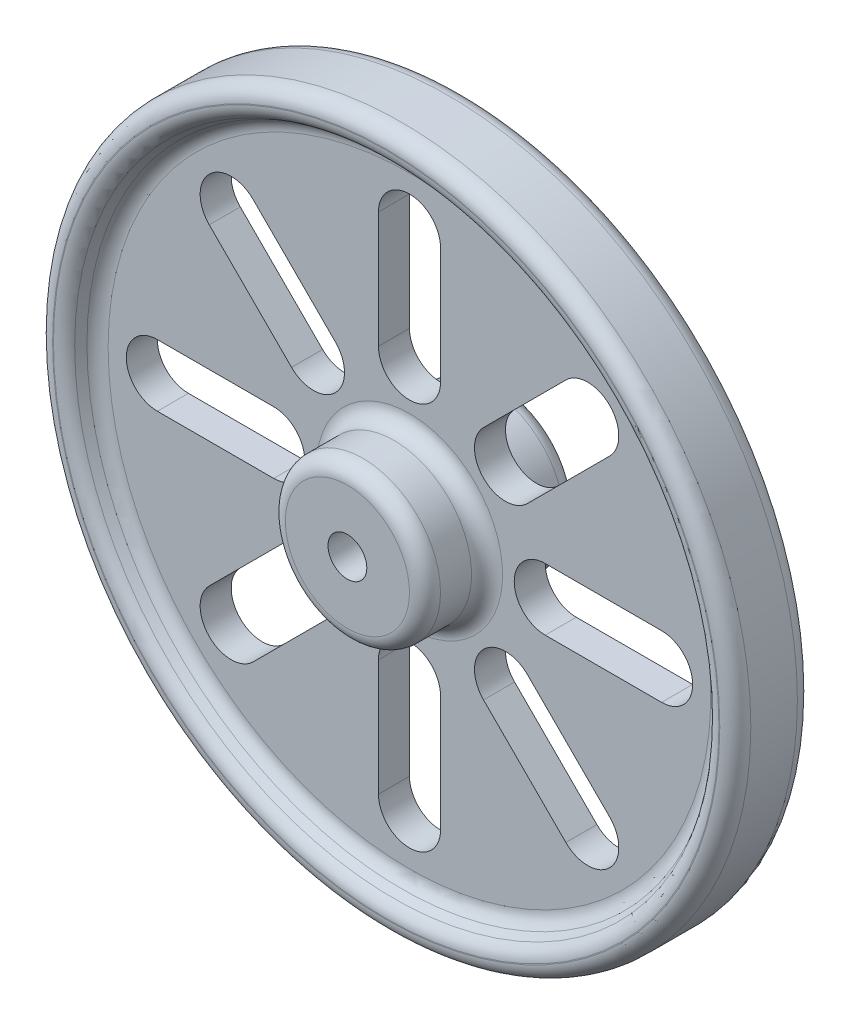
ISO-10303-21;
HEADER;
FILE_DESCRIPTION(('STEP AP214'),'2;1');
FILE_NAME('part.step','',(''),(''),'','','');
FILE_SCHEMA(('AUTOMOTIVE_DESIGN { 1 0 10303 214 1 1 1 1 }'));
ENDSEC;
DATA;
#1=APPLICATION_CONTEXT('core data for automotive mechanical design processes');
#2=APPLICATION_PROTOCOL_DEFINITION('international standard','automotive_design',2000,#1);
#3=PRODUCT_CONTEXT('',#1,'mechanical');
#4=PRODUCT('Part','Part','',(#3));
#5=PRODUCT_RELATED_PRODUCT_CATEGORY('part','',(#4));
#6=PRODUCT_DEFINITION_FORMATION('','',#4);
#7=PRODUCT_DEFINITION_CONTEXT('part definition',#1,'design');
#8=PRODUCT_DEFINITION('design','',#6,#7);
#9=PRODUCT_DEFINITION_SHAPE('','',#8);
#10=(LENGTH_UNIT() NAMED_UNIT(*) SI_UNIT(.MILLI.,.METRE.));
#11=(NAMED_UNIT(*) PLANE_ANGLE_UNIT() SI_UNIT($,.RADIAN.));
#12=(NAMED_UNIT(*) SI_UNIT($,.STERADIAN.) SOLID_ANGLE_UNIT());
#13=UNCERTAINTY_MEASURE_WITH_UNIT(LENGTH_MEASURE(1.E-05),#10,'distance_accuracy_value','');
#14=(GEOMETRIC_REPRESENTATION_CONTEXT(3) GLOBAL_UNCERTAINTY_ASSIGNED_CONTEXT((#13)) GLOBAL_UNIT_ASSIGNED_CONTEXT((#10,
#11,#12)) REPRESENTATION_CONTEXT('',''));
#15=CARTESIAN_POINT('',(0.,0.,0.));
#16=DIRECTION('',(0.,0.,1.));
#17=DIRECTION('',(1.,0.,0.));
#18=AXIS2_PLACEMENT_3D('',#15,#16,#17);
#19=CARTESIAN_POINT('',(0.,0.,10.));
#20=DIRECTION('',(0.,0.,-1.));
#21=DIRECTION('',(-1.,0.,0.));
#22=AXIS2_PLACEMENT_3D('',#19,#20,#21);
#23=CYLINDRICAL_SURFACE('',#22,10.);
#24=CARTESIAN_POINT('',(0.,0.,4.));
#25=DIRECTION('',(0.,0.,-1.));
#26=DIRECTION('',(-1.,0.,0.));
#27=AXIS2_PLACEMENT_3D('',#24,#25,#26);
#28=CIRCLE('',#27,10.);
#29=CARTESIAN_POINT('',(-10.,0.,4.));
#30=VERTEX_POINT('',#29);
#31=EDGE_CURVE('E547',#30,#30,#28,.F.);
#32=ORIENTED_EDGE('',*,*,#31,.T.);
#33=EDGE_LOOP('',(#32));
#34=FACE_BOUND('',#33,.T.);
#35=CARTESIAN_POINT('',(0.,0.,8.));
#36=DIRECTION('',(0.,0.,1.));
#37=DIRECTION('',(1.,0.,0.));
#38=AXIS2_PLACEMENT_3D('',#35,#36,#37);
#39=CIRCLE('',#38,10.);
#40=CARTESIAN_POINT('',(10.,0.,8.));
#41=VERTEX_POINT('',#40);
#42=EDGE_CURVE('E544',#41,#41,#39,.F.);
#43=ORIENTED_EDGE('',*,*,#42,.T.);
#44=EDGE_LOOP('',(#43));
#45=FACE_BOUND('',#44,.T.);
#46=ADVANCED_FACE('F38',(#34,#45),#23,.T.);
#47=CARTESIAN_POINT('',(0.,0.,10.));
#48=DIRECTION('',(0.,0.,1.));
#49=DIRECTION('',(1.,0.,0.));
#50=AXIS2_PLACEMENT_3D('',#47,#48,#49);
#51=PLANE('',#50);
#52=CARTESIAN_POINT('',(0.,0.,10.));
#53=DIRECTION('',(0.,0.,1.));
#54=DIRECTION('',(1.,0.,0.));
#55=AXIS2_PLACEMENT_3D('',#52,#53,#54);
#56=CIRCLE('',#55,8.);
#57=CARTESIAN_POINT('',(8.,0.,10.));
#58=VERTEX_POINT('',#57);
#59=EDGE_CURVE('E550',#58,#58,#56,.T.);
#60=ORIENTED_EDGE('',*,*,#59,.T.);
#61=EDGE_LOOP('',(#60));
#62=FACE_BOUND('',#61,.T.);
#63=CARTESIAN_POINT('',(0.,0.,10.));
#64=DIRECTION('',(0.,0.,1.));
#65=DIRECTION('',(1.,0.,0.));
#66=AXIS2_PLACEMENT_3D('',#63,#64,#65);
#67=CIRCLE('',#66,2.49999999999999);
#68=CARTESIAN_POINT('',(2.49999999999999,0.,10.));
#69=VERTEX_POINT('',#68);
#70=EDGE_CURVE('E1184',#69,#69,#67,.T.);
#71=ORIENTED_EDGE('',*,*,#70,.F.);
#72=EDGE_LOOP('',(#71));
#73=FACE_BOUND('',#72,.T.);
#74=ADVANCED_FACE('F619',(#62,#73),#51,.T.);
#75=CARTESIAN_POINT('',(0.,41.7320508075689,5.));
#76=DIRECTION('',(0.,0.,-1.));
#77=DIRECTION('',(-1.,0.,0.));
#78=AXIS2_PLACEMENT_3D('',#75,#76,#77);
#79=PLANE('',#78);
#80=CARTESIAN_POINT('',(0.,0.,5.));
#81=DIRECTION('',(0.,0.,-1.));
#82=DIRECTION('',(-1.,0.,0.));
#83=AXIS2_PLACEMENT_3D('',#80,#81,#82);
#84=CIRCLE('',#83,43.);
#85=CARTESIAN_POINT('',(-43.,0.,5.));
#86=VERTEX_POINT('',#85);
#87=EDGE_CURVE('E511',#86,#86,#84,.F.);
#88=ORIENTED_EDGE('',*,*,#87,.T.);
#89=EDGE_LOOP('',(#88));
#90=FACE_BOUND('',#89,.T.);
#91=CARTESIAN_POINT('',(0.,0.,5.));
#92=DIRECTION('',(0.,0.,-1.));
#93=DIRECTION('',(-1.,0.,0.));
#94=AXIS2_PLACEMENT_3D('',#91,#92,#93);
#95=CIRCLE('',#94,42.8867513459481);
#96=CARTESIAN_POINT('',(-42.8867513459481,0.,5.));
#97=VERTEX_POINT('',#96);
#98=EDGE_CURVE('E508',#97,#97,#95,.T.);
#99=ORIENTED_EDGE('',*,*,#98,.T.);
#100=EDGE_LOOP('',(#99));
#101=FACE_BOUND('',#100,.T.);
#102=ADVANCED_FACE('F625',(#90,#101),#79,.F.);
#103=CARTESIAN_POINT('',(0.,0.,5.));
#104=DIRECTION('',(0.,0.,1.));
#105=DIRECTION('',(1.,0.,0.));
#106=AXIS2_PLACEMENT_3D('',#103,#104,#105);
#107=CONICAL_SURFACE('',#106,41.7320508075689,0.523598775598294);
#108=CARTESIAN_POINT('',(0.,0.,3.99999999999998));
#109=DIRECTION('',(0.,0.,-1.));
#110=DIRECTION('',(-1.,0.,0.));
#111=AXIS2_PLACEMENT_3D('',#108,#109,#110);
#112=CIRCLE('',#111,41.1547005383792);
#113=CARTESIAN_POINT('',(-41.1547005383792,0.,3.99999999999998));
#114=VERTEX_POINT('',#113);
#115=EDGE_CURVE('E523',#114,#114,#112,.F.);
#116=ORIENTED_EDGE('',*,*,#115,.T.);
#117=EDGE_LOOP('',(#116));
#118=FACE_BOUND('',#117,.T.);
#119=CARTESIAN_POINT('',(0.,0.,3.00000000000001));
#120=DIRECTION('',(0.,0.,1.));
#121=DIRECTION('',(1.,0.,0.));
#122=AXIS2_PLACEMENT_3D('',#119,#120,#121);
#123=CIRCLE('',#122,40.5773502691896);
#124=CARTESIAN_POINT('',(40.5773502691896,0.,3.00000000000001));
#125=VERTEX_POINT('',#124);
#126=EDGE_CURVE('E520',#125,#125,#123,.F.);
#127=ORIENTED_EDGE('',*,*,#126,.T.);
#128=EDGE_LOOP('',(#127));
#129=FACE_BOUND('',#128,.T.);
#130=ADVANCED_FACE('F649',(#118,#129),#107,.F.);
#131=CARTESIAN_POINT('',(0.,10.,2.));
#132=DIRECTION('',(0.,0.,-1.));
#133=DIRECTION('',(-1.,0.,0.));
#134=AXIS2_PLACEMENT_3D('',#131,#132,#133);
#135=PLANE('',#134);
#136=CARTESIAN_POINT('',(0.,0.,2.));
#137=DIRECTION('',(0.,0.,-1.));
#138=DIRECTION('',(-1.,0.,0.));
#139=AXIS2_PLACEMENT_3D('',#136,#137,#138);
#140=CIRCLE('',#139,38.8452994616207);
#141=CARTESIAN_POINT('',(-38.8452994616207,0.,2.));
#142=VERTEX_POINT('',#141);
#143=EDGE_CURVE('E541',#142,#142,#140,.F.);
#144=ORIENTED_EDGE('',*,*,#143,.T.);
#145=EDGE_LOOP('',(#144));
#146=FACE_BOUND('',#145,.T.);
#147=CARTESIAN_POINT('',(0.,0.,2.));
#148=DIRECTION('',(0.,0.,-1.));
#149=DIRECTION('',(-1.,0.,0.));
#150=AXIS2_PLACEMENT_3D('',#147,#148,#149);
#151=CIRCLE('',#150,12.);
#152=CARTESIAN_POINT('',(-12.,0.,2.));
#153=VERTEX_POINT('',#152);
#154=EDGE_CURVE('E538',#153,#153,#151,.T.);
#155=ORIENTED_EDGE('',*,*,#154,.T.);
#156=EDGE_LOOP('',(#155));
#157=FACE_BOUND('',#156,.T.);
#158=DIRECTION('',(0.707106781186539,0.707106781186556,0.));
#159=VECTOR('',#158,1.);
#160=CARTESIAN_POINT('',(15.2027957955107,9.54594154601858,2.));
#161=LINE('',#160,#159);
#162=CARTESIAN_POINT('',(15.2027957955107,9.54594154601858,2.));
#163=VERTEX_POINT('',#162);
#164=CARTESIAN_POINT('',(25.8093975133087,20.1525432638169,2.));
#165=VERTEX_POINT('',#164);
#166=EDGE_CURVE('E259',#163,#165,#161,.T.);
#167=ORIENTED_EDGE('',*,*,#166,.F.);
#168=CARTESIAN_POINT('',(12.3743686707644,12.3743686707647,2.));
#169=DIRECTION('',(0.,0.,1.));
#170=DIRECTION('',(0.707106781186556,-0.707106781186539,0.));
#171=AXIS2_PLACEMENT_3D('',#168,#169,#170);
#172=CIRCLE('',#171,4.);
#173=CARTESIAN_POINT('',(9.54594154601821,15.2027957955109,2.));
#174=VERTEX_POINT('',#173);
#175=EDGE_CURVE('E53',#174,#163,#172,.T.);
#176=ORIENTED_EDGE('',*,*,#175,.F.);
#177=DIRECTION('',(-0.707106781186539,-0.707106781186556,0.));
#178=VECTOR('',#177,1.);
#179=CARTESIAN_POINT('',(9.54594154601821,15.2027957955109,2.));
#180=LINE('',#179,#178);
#181=CARTESIAN_POINT('',(20.1525432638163,25.8093975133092,2.));
#182=VERTEX_POINT('',#181);
#183=EDGE_CURVE('E266',#182,#174,#180,.T.);
#184=ORIENTED_EDGE('',*,*,#183,.F.);
#185=CARTESIAN_POINT('',(22.9809703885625,22.9809703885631,2.));
#186=DIRECTION('',(0.,0.,1.));
#187=DIRECTION('',(0.707106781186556,-0.707106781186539,0.));
#188=AXIS2_PLACEMENT_3D('',#185,#186,#187);
#189=CIRCLE('',#188,4.);
#190=EDGE_CURVE('E250',#165,#182,#189,.T.);
#191=ORIENTED_EDGE('',*,*,#190,.F.);
#192=EDGE_LOOP('',(#167,#176,#184,#191));
#193=FACE_BOUND('',#192,.T.);
#194=DIRECTION('',(1.,0.,0.));
#195=VECTOR('',#194,1.);
#196=CARTESIAN_POINT('',(17.5,-3.99999999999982,2.));
#197=LINE('',#196,#195);
#198=CARTESIAN_POINT('',(17.5,-3.99999999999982,2.));
#199=VERTEX_POINT('',#198);
#200=CARTESIAN_POINT('',(32.5,-3.99999999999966,2.));
#201=VERTEX_POINT('',#200);
#202=EDGE_CURVE('E277',#199,#201,#197,.T.);
#203=ORIENTED_EDGE('',*,*,#202,.F.);
#204=CARTESIAN_POINT('',(17.5,1.83302770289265E-13,2.));
#205=DIRECTION('',(0.,0.,1.));
#206=DIRECTION('',(0.,-1.,0.));
#207=AXIS2_PLACEMENT_3D('',#204,#205,#206);
#208=CIRCLE('',#207,4.);
#209=CARTESIAN_POINT('',(17.5,4.00000000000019,2.));
#210=VERTEX_POINT('',#209);
#211=EDGE_CURVE('E273',#210,#199,#208,.T.);
#212=ORIENTED_EDGE('',*,*,#211,.F.);
#213=DIRECTION('',(-1.,0.,0.));
#214=VECTOR('',#213,1.);
#215=CARTESIAN_POINT('',(17.5,4.00000000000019,2.));
#216=LINE('',#215,#214);
#217=CARTESIAN_POINT('',(32.5,4.00000000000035,2.));
#218=VERTEX_POINT('',#217);
#219=EDGE_CURVE('E283',#218,#210,#216,.T.);
#220=ORIENTED_EDGE('',*,*,#219,.F.);
#221=CARTESIAN_POINT('',(32.5,3.43174885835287E-13,2.));
#222=DIRECTION('',(0.,0.,1.));
#223=DIRECTION('',(0.,-1.,0.));
#224=AXIS2_PLACEMENT_3D('',#221,#222,#223);
#225=CIRCLE('',#224,4.);
#226=EDGE_CURVE('E280',#201,#218,#225,.T.);
#227=ORIENTED_EDGE('',*,*,#226,.F.);
#228=EDGE_LOOP('',(#203,#212,#220,#227));
#229=FACE_BOUND('',#228,.T.);
#230=DIRECTION('',(0.707106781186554,-0.707106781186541,0.));
#231=VECTOR('',#230,1.);
#232=CARTESIAN_POINT('',(9.54594154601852,-15.2027957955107,2.));
#233=LINE('',#232,#231);
#234=CARTESIAN_POINT('',(9.54594154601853,-15.2027957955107,2.));
#235=VERTEX_POINT('',#234);
#236=CARTESIAN_POINT('',(20.1525432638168,-25.8093975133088,2.));
#237=VERTEX_POINT('',#236);
#238=EDGE_CURVE('E297',#235,#237,#233,.T.);
#239=ORIENTED_EDGE('',*,*,#238,.F.);
#240=CARTESIAN_POINT('',(12.3743686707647,-12.3743686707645,2.));
#241=DIRECTION('',(0.,0.,1.));
#242=DIRECTION('',(-0.707106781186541,-0.707106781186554,0.));
#243=AXIS2_PLACEMENT_3D('',#240,#241,#242);
#244=CIRCLE('',#243,4.);
#245=CARTESIAN_POINT('',(15.2027957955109,-9.54594154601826,2.));
#246=VERTEX_POINT('',#245);
#247=EDGE_CURVE('E289',#246,#235,#244,.T.);
#248=ORIENTED_EDGE('',*,*,#247,.F.);
#249=DIRECTION('',(-0.707106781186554,0.707106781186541,0.));
#250=VECTOR('',#249,1.);
#251=CARTESIAN_POINT('',(15.2027957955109,-9.54594154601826,2.));
#252=LINE('',#251,#250);
#253=CARTESIAN_POINT('',(25.8093975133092,-20.1525432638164,2.));
#254=VERTEX_POINT('',#253);
#255=EDGE_CURVE('E303',#254,#246,#252,.T.);
#256=ORIENTED_EDGE('',*,*,#255,.F.);
#257=CARTESIAN_POINT('',(22.980970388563,-22.9809703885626,2.));
#258=DIRECTION('',(0.,0.,1.));
#259=DIRECTION('',(-0.707106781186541,-0.707106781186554,0.));
#260=AXIS2_PLACEMENT_3D('',#257,#258,#259);
#261=CIRCLE('',#260,4.);
#262=EDGE_CURVE('E300',#237,#254,#261,.T.);
#263=ORIENTED_EDGE('',*,*,#262,.F.);
#264=EDGE_LOOP('',(#239,#248,#256,#263));
#265=FACE_BOUND('',#264,.T.);
#266=DIRECTION('',(0.,-1.,0.));
#267=VECTOR('',#266,1.);
#268=CARTESIAN_POINT('',(-4.,-17.5,2.));
#269=LINE('',#268,#267);
#270=CARTESIAN_POINT('',(-4.,-17.5,2.));
#271=VERTEX_POINT('',#270);
#272=CARTESIAN_POINT('',(-4.,-32.5,2.));
#273=VERTEX_POINT('',#272);
#274=EDGE_CURVE('E317',#271,#273,#269,.T.);
#275=ORIENTED_EDGE('',*,*,#274,.F.);
#276=CARTESIAN_POINT('',(0.,-17.5,2.));
#277=DIRECTION('',(0.,0.,1.));
#278=DIRECTION('',(-1.,0.,0.));
#279=AXIS2_PLACEMENT_3D('',#276,#277,#278);
#280=CIRCLE('',#279,4.);
#281=CARTESIAN_POINT('',(4.,-17.5,2.));
#282=VERTEX_POINT('',#281);
#283=EDGE_CURVE('E309',#282,#271,#280,.T.);
#284=ORIENTED_EDGE('',*,*,#283,.F.);
#285=DIRECTION('',(0.,1.,0.));
#286=VECTOR('',#285,1.);
#287=CARTESIAN_POINT('',(4.,-17.5,2.));
#288=LINE('',#287,#286);
#289=CARTESIAN_POINT('',(4.00000000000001,-32.5,2.));
#290=VERTEX_POINT('',#289);
#291=EDGE_CURVE('E323',#290,#282,#288,.T.);
#292=ORIENTED_EDGE('',*,*,#291,.F.);
#293=CARTESIAN_POINT('',(0.,-32.5,2.));
#294=DIRECTION('',(0.,0.,1.));
#295=DIRECTION('',(-1.,0.,0.));
#296=AXIS2_PLACEMENT_3D('',#293,#294,#295);
#297=CIRCLE('',#296,4.);
#298=EDGE_CURVE('E320',#273,#290,#297,.T.);
#299=ORIENTED_EDGE('',*,*,#298,.F.);
#300=EDGE_LOOP('',(#275,#284,#292,#299));
#301=FACE_BOUND('',#300,.T.);
#302=DIRECTION('',(-0.707106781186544,-0.707106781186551,0.));
#303=VECTOR('',#302,1.);
#304=CARTESIAN_POINT('',(-15.2027957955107,-9.54594154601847,2.));
#305=LINE('',#304,#303);
#306=CARTESIAN_POINT('',(-15.2027957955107,-9.54594154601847,2.));
#307=VERTEX_POINT('',#306);
#308=CARTESIAN_POINT('',(-25.8093975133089,-20.1525432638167,2.));
#309=VERTEX_POINT('',#308);
#310=EDGE_CURVE('E337',#307,#309,#305,.T.);
#311=ORIENTED_EDGE('',*,*,#310,.F.);
#312=CARTESIAN_POINT('',(-12.3743686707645,-12.3743686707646,2.));
#313=DIRECTION('',(0.,0.,1.));
#314=DIRECTION('',(-0.707106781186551,0.707106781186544,0.));
#315=AXIS2_PLACEMENT_3D('',#312,#313,#314);
#316=CIRCLE('',#315,4.);
#317=CARTESIAN_POINT('',(-9.54594154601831,-15.2027957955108,2.));
#318=VERTEX_POINT('',#317);
#319=EDGE_CURVE('E329',#318,#307,#316,.T.);
#320=ORIENTED_EDGE('',*,*,#319,.F.);
#321=DIRECTION('',(0.707106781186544,0.707106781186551,0.));
#322=VECTOR('',#321,1.);
#323=CARTESIAN_POINT('',(-9.54594154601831,-15.2027957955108,2.));
#324=LINE('',#323,#322);
#325=CARTESIAN_POINT('',(-20.1525432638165,-25.8093975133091,2.));
#326=VERTEX_POINT('',#325);
#327=EDGE_CURVE('E343',#326,#318,#324,.T.);
#328=ORIENTED_EDGE('',*,*,#327,.F.);
#329=CARTESIAN_POINT('',(-22.9809703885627,-22.9809703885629,2.));
#330=DIRECTION('',(0.,0.,1.));
#331=DIRECTION('',(-0.707106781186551,0.707106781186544,0.));
#332=AXIS2_PLACEMENT_3D('',#329,#330,#331);
#333=CIRCLE('',#332,4.);
#334=EDGE_CURVE('E340',#309,#326,#333,.T.);
#335=ORIENTED_EDGE('',*,*,#334,.F.);
#336=EDGE_LOOP('',(#311,#320,#328,#335));
#337=FACE_BOUND('',#336,.T.);
#338=DIRECTION('',(-1.,0.,0.));
#339=VECTOR('',#338,1.);
#340=CARTESIAN_POINT('',(-17.5,3.99999999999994,2.));
#341=LINE('',#340,#339);
#342=CARTESIAN_POINT('',(-17.5,3.99999999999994,2.));
#343=VERTEX_POINT('',#342);
#344=CARTESIAN_POINT('',(-32.5,3.99999999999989,2.));
#345=VERTEX_POINT('',#344);
#346=EDGE_CURVE('E357',#343,#345,#341,.T.);
#347=ORIENTED_EDGE('',*,*,#346,.F.);
#348=CARTESIAN_POINT('',(-17.5,0.,2.));
#349=DIRECTION('',(0.,0.,1.));
#350=DIRECTION('',(0.,1.,0.));
#351=AXIS2_PLACEMENT_3D('',#348,#349,#350);
#352=CIRCLE('',#351,4.);
#353=CARTESIAN_POINT('',(-17.5,-4.00000000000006,2.));
#354=VERTEX_POINT('',#353);
#355=EDGE_CURVE('E349',#354,#343,#352,.T.);
#356=ORIENTED_EDGE('',*,*,#355,.F.);
#357=DIRECTION('',(1.,0.,0.));
#358=VECTOR('',#357,1.);
#359=CARTESIAN_POINT('',(-17.5,-4.00000000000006,2.));
#360=LINE('',#359,#358);
#361=CARTESIAN_POINT('',(-32.5,-4.00000000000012,2.));
#362=VERTEX_POINT('',#361);
#363=EDGE_CURVE('E363',#362,#354,#360,.T.);
#364=ORIENTED_EDGE('',*,*,#363,.F.);
#365=CARTESIAN_POINT('',(-32.5,-1.16228598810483E-13,2.));
#366=DIRECTION('',(0.,0.,1.));
#367=DIRECTION('',(0.,1.,0.));
#368=AXIS2_PLACEMENT_3D('',#365,#366,#367);
#369=CIRCLE('',#368,4.);
#370=EDGE_CURVE('E360',#345,#362,#369,.T.);
#371=ORIENTED_EDGE('',*,*,#370,.F.);
#372=EDGE_LOOP('',(#347,#356,#364,#371));
#373=FACE_BOUND('',#372,.T.);
#374=DIRECTION('',(-0.707106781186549,0.707106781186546,0.));
#375=VECTOR('',#374,1.);
#376=CARTESIAN_POINT('',(-9.54594154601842,15.2027957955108,2.));
#377=LINE('',#376,#375);
#378=CARTESIAN_POINT('',(-9.54594154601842,15.2027957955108,2.));
#379=VERTEX_POINT('',#378);
#380=CARTESIAN_POINT('',(-20.1525432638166,25.809397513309,2.));
#381=VERTEX_POINT('',#380);
#382=EDGE_CURVE('E377',#379,#381,#377,.T.);
#383=ORIENTED_EDGE('',*,*,#382,.F.);
#384=CARTESIAN_POINT('',(-12.3743686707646,12.3743686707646,2.));
#385=DIRECTION('',(0.,0.,1.));
#386=DIRECTION('',(0.707106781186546,0.707106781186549,0.));
#387=AXIS2_PLACEMENT_3D('',#384,#385,#386);
#388=CIRCLE('',#387,4.);
#389=CARTESIAN_POINT('',(-15.2027957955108,9.54594154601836,2.));
#390=VERTEX_POINT('',#389);
#391=EDGE_CURVE('E369',#390,#379,#388,.T.);
#392=ORIENTED_EDGE('',*,*,#391,.F.);
#393=DIRECTION('',(0.707106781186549,-0.707106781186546,0.));
#394=VECTOR('',#393,1.);
#395=CARTESIAN_POINT('',(-15.2027957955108,9.54594154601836,2.));
#396=LINE('',#395,#394);
#397=CARTESIAN_POINT('',(-25.809397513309,20.1525432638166,2.));
#398=VERTEX_POINT('',#397);
#399=EDGE_CURVE('E383',#398,#390,#396,.T.);
#400=ORIENTED_EDGE('',*,*,#399,.F.);
#401=CARTESIAN_POINT('',(-22.9809703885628,22.9809703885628,2.));
#402=DIRECTION('',(0.,0.,1.));
#403=DIRECTION('',(0.707106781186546,0.707106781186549,0.));
#404=AXIS2_PLACEMENT_3D('',#401,#402,#403);
#405=CIRCLE('',#404,4.);
#406=EDGE_CURVE('E380',#381,#398,#405,.T.);
#407=ORIENTED_EDGE('',*,*,#406,.F.);
#408=EDGE_LOOP('',(#383,#392,#400,#407));
#409=FACE_BOUND('',#408,.T.);
#410=DIRECTION('',(0.,1.,0.));
#411=VECTOR('',#410,1.);
#412=CARTESIAN_POINT('',(4.,17.5,2.));
#413=LINE('',#412,#411);
#414=CARTESIAN_POINT('',(4.,17.5,2.));
#415=VERTEX_POINT('',#414);
#416=CARTESIAN_POINT('',(4.,32.5,2.));
#417=VERTEX_POINT('',#416);
#418=EDGE_CURVE('E397',#415,#417,#413,.T.);
#419=ORIENTED_EDGE('',*,*,#418,.F.);
#420=CARTESIAN_POINT('',(0.,17.5,2.));
#421=DIRECTION('',(0.,0.,1.));
#422=DIRECTION('',(1.,0.,0.));
#423=AXIS2_PLACEMENT_3D('',#420,#421,#422);
#424=CIRCLE('',#423,4.);
#425=CARTESIAN_POINT('',(-4.,17.5,2.));
#426=VERTEX_POINT('',#425);
#427=EDGE_CURVE('E389',#426,#415,#424,.T.);
#428=ORIENTED_EDGE('',*,*,#427,.F.);
#429=DIRECTION('',(0.,-1.,0.));
#430=VECTOR('',#429,1.);
#431=CARTESIAN_POINT('',(-4.,17.5,2.));
#432=LINE('',#431,#430);
#433=CARTESIAN_POINT('',(-4.00000000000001,32.5,2.));
#434=VERTEX_POINT('',#433);
#435=EDGE_CURVE('E403',#434,#426,#432,.T.);
#436=ORIENTED_EDGE('',*,*,#435,.F.);
#437=CARTESIAN_POINT('',(0.,32.5,2.));
#438=DIRECTION('',(0.,0.,1.));
#439=DIRECTION('',(1.,0.,0.));
#440=AXIS2_PLACEMENT_3D('',#437,#438,#439);
#441=CIRCLE('',#440,4.);
#442=EDGE_CURVE('E400',#417,#434,#441,.T.);
#443=ORIENTED_EDGE('',*,*,#442,.F.);
#444=EDGE_LOOP('',(#419,#428,#436,#443));
#445=FACE_BOUND('',#444,.T.);
#446=ADVANCED_FACE('F263',(#146,#157,#193,#229,#265,#301,#337,#373,#409,#445),#135,.F.);
#447=CARTESIAN_POINT('',(0.,10.,-2.));
#448=DIRECTION('',(0.,0.,1.));
#449=DIRECTION('',(1.,0.,0.));
#450=AXIS2_PLACEMENT_3D('',#447,#448,#449);
#451=PLANE('',#450);
#452=CARTESIAN_POINT('',(0.,0.,-2.));
#453=DIRECTION('',(0.,0.,1.));
#454=DIRECTION('',(1.,0.,0.));
#455=AXIS2_PLACEMENT_3D('',#452,#453,#454);
#456=CIRCLE('',#455,12.);
#457=CARTESIAN_POINT('',(12.,0.,-2.));
#458=VERTEX_POINT('',#457);
#459=EDGE_CURVE('E556',#458,#458,#456,.T.);
#460=ORIENTED_EDGE('',*,*,#459,.T.);
#461=EDGE_LOOP('',(#460));
#462=FACE_BOUND('',#461,.T.);
#463=CARTESIAN_POINT('',(0.,0.,-2.));
#464=DIRECTION('',(0.,0.,1.));
#465=DIRECTION('',(1.,0.,0.));
#466=AXIS2_PLACEMENT_3D('',#463,#464,#465);
#467=CIRCLE('',#466,38.8452994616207);
#468=CARTESIAN_POINT('',(38.8452994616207,0.,-2.));
#469=VERTEX_POINT('',#468);
#470=EDGE_CURVE('E553',#469,#469,#467,.F.);
#471=ORIENTED_EDGE('',*,*,#470,.T.);
#472=EDGE_LOOP('',(#471));
#473=FACE_BOUND('',#472,.T.);
#474=DIRECTION('',(-0.707106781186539,-0.707106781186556,0.));
#475=VECTOR('',#474,1.);
#476=CARTESIAN_POINT('',(2.17157287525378,7.82842712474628,-2.));
#477=LINE('',#476,#475);
#478=CARTESIAN_POINT('',(20.1525432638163,25.8093975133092,-2.));
#479=VERTEX_POINT('',#478);
#480=CARTESIAN_POINT('',(9.54594154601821,15.2027957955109,-2.));
#481=VERTEX_POINT('',#480);
#482=EDGE_CURVE('E502',#479,#481,#477,.T.);
#483=ORIENTED_EDGE('',*,*,#482,.T.);
#484=CARTESIAN_POINT('',(12.3743686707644,12.3743686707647,-2.));
#485=DIRECTION('',(0.,0.,1.));
#486=DIRECTION('',(1.,0.,0.));
#487=AXIS2_PLACEMENT_3D('',#484,#485,#486);
#488=CIRCLE('',#487,4.);
#489=CARTESIAN_POINT('',(15.2027957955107,9.54594154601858,-2.));
#490=VERTEX_POINT('',#489);
#491=EDGE_CURVE('E505',#481,#490,#488,.T.);
#492=ORIENTED_EDGE('',*,*,#491,.T.);
#493=DIRECTION('',(0.707106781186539,0.707106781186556,0.));
#494=VECTOR('',#493,1.);
#495=CARTESIAN_POINT('',(7.82842712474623,2.17157287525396,-2.));
#496=LINE('',#495,#494);
#497=CARTESIAN_POINT('',(25.8093975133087,20.1525432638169,-2.));
#498=VERTEX_POINT('',#497);
#499=EDGE_CURVE('E499',#490,#498,#496,.T.);
#500=ORIENTED_EDGE('',*,*,#499,.T.);
#501=CARTESIAN_POINT('',(22.9809703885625,22.9809703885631,-2.));
#502=DIRECTION('',(0.,0.,1.));
#503=DIRECTION('',(1.,0.,0.));
#504=AXIS2_PLACEMENT_3D('',#501,#502,#503);
#505=CIRCLE('',#504,4.);
#506=EDGE_CURVE('E253',#498,#479,#505,.T.);
#507=ORIENTED_EDGE('',*,*,#506,.T.);
#508=EDGE_LOOP('',(#483,#492,#500,#507));
#509=FACE_BOUND('',#508,.T.);
#510=DIRECTION('',(-1.,0.,0.));
#511=VECTOR('',#510,1.);
#512=CARTESIAN_POINT('',(0.,4.,-2.));
#513=LINE('',#512,#511);
#514=CARTESIAN_POINT('',(32.5,4.00000000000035,-2.));
#515=VERTEX_POINT('',#514);
#516=CARTESIAN_POINT('',(17.5,4.00000000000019,-2.));
#517=VERTEX_POINT('',#516);
#518=EDGE_CURVE('E493',#515,#517,#513,.T.);
#519=ORIENTED_EDGE('',*,*,#518,.T.);
#520=CARTESIAN_POINT('',(17.5,1.83302770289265E-13,-2.));
#521=DIRECTION('',(0.,0.,1.));
#522=DIRECTION('',(1.,0.,0.));
#523=AXIS2_PLACEMENT_3D('',#520,#521,#522);
#524=CIRCLE('',#523,4.);
#525=CARTESIAN_POINT('',(17.5,-3.99999999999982,-2.));
#526=VERTEX_POINT('',#525);
#527=EDGE_CURVE('E496',#517,#526,#524,.T.);
#528=ORIENTED_EDGE('',*,*,#527,.T.);
#529=DIRECTION('',(1.,0.,0.));
#530=VECTOR('',#529,1.);
#531=CARTESIAN_POINT('',(1.49070829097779E-13,-4.00000000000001,-2.));
#532=LINE('',#531,#530);
#533=CARTESIAN_POINT('',(32.5,-3.99999999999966,-2.));
#534=VERTEX_POINT('',#533);
#535=EDGE_CURVE('E487',#526,#534,#532,.T.);
#536=ORIENTED_EDGE('',*,*,#535,.T.);
#537=CARTESIAN_POINT('',(32.5,3.43174885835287E-13,-2.));
#538=DIRECTION('',(0.,0.,1.));
#539=DIRECTION('',(1.,0.,0.));
#540=AXIS2_PLACEMENT_3D('',#537,#538,#539);
#541=CIRCLE('',#540,4.);
#542=EDGE_CURVE('E490',#534,#515,#541,.T.);
#543=ORIENTED_EDGE('',*,*,#542,.T.);
#544=EDGE_LOOP('',(#519,#528,#536,#543));
#545=FACE_BOUND('',#544,.T.);
#546=DIRECTION('',(-0.707106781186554,0.707106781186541,0.));
#547=VECTOR('',#546,1.);
#548=CARTESIAN_POINT('',(-2.17157287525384,7.82842712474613,-2.));
#549=LINE('',#548,#547);
#550=CARTESIAN_POINT('',(25.8093975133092,-20.1525432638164,-2.));
#551=VERTEX_POINT('',#550);
#552=CARTESIAN_POINT('',(15.2027957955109,-9.54594154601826,-2.));
#553=VERTEX_POINT('',#552);
#554=EDGE_CURVE('E481',#551,#553,#549,.T.);
#555=ORIENTED_EDGE('',*,*,#554,.T.);
#556=CARTESIAN_POINT('',(12.3743686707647,-12.3743686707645,-2.));
#557=DIRECTION('',(0.,0.,1.));
#558=DIRECTION('',(1.,0.,0.));
#559=AXIS2_PLACEMENT_3D('',#556,#557,#558);
#560=CIRCLE('',#559,4.);
#561=CARTESIAN_POINT('',(9.54594154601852,-15.2027957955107,-2.));
#562=VERTEX_POINT('',#561);
#563=EDGE_CURVE('E484',#553,#562,#560,.T.);
#564=ORIENTED_EDGE('',*,*,#563,.T.);
#565=DIRECTION('',(0.707106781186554,-0.707106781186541,0.));
#566=VECTOR('',#565,1.);
#567=CARTESIAN_POINT('',(-7.82842712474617,2.17157287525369,-2.));
#568=LINE('',#567,#566);
#569=CARTESIAN_POINT('',(20.1525432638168,-25.8093975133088,-2.));
#570=VERTEX_POINT('',#569);
#571=EDGE_CURVE('E475',#562,#570,#568,.T.);
#572=ORIENTED_EDGE('',*,*,#571,.T.);
#573=CARTESIAN_POINT('',(22.980970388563,-22.9809703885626,-2.));
#574=DIRECTION('',(0.,0.,1.));
#575=DIRECTION('',(1.,0.,0.));
#576=AXIS2_PLACEMENT_3D('',#573,#574,#575);
#577=CIRCLE('',#576,4.);
#578=EDGE_CURVE('E478',#570,#551,#577,.T.);
#579=ORIENTED_EDGE('',*,*,#578,.T.);
#580=EDGE_LOOP('',(#555,#564,#572,#579));
#581=FACE_BOUND('',#580,.T.);
#582=DIRECTION('',(0.,1.,0.));
#583=VECTOR('',#582,1.);
#584=CARTESIAN_POINT('',(4.,10.,-2.));
#585=LINE('',#584,#583);
#586=CARTESIAN_POINT('',(4.00000000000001,-32.5,-2.));
#587=VERTEX_POINT('',#586);
#588=CARTESIAN_POINT('',(4.,-17.5,-2.));
#589=VERTEX_POINT('',#588);
#590=EDGE_CURVE('E469',#587,#589,#585,.T.);
#591=ORIENTED_EDGE('',*,*,#590,.T.);
#592=CARTESIAN_POINT('',(0.,-17.5,-2.));
#593=DIRECTION('',(0.,0.,1.));
#594=DIRECTION('',(1.,0.,0.));
#595=AXIS2_PLACEMENT_3D('',#592,#593,#594);
#596=CIRCLE('',#595,4.);
#597=CARTESIAN_POINT('',(-4.,-17.5,-2.));
#598=VERTEX_POINT('',#597);
#599=EDGE_CURVE('E472',#589,#598,#596,.T.);
#600=ORIENTED_EDGE('',*,*,#599,.T.);
#601=DIRECTION('',(0.,-1.,0.));
#602=VECTOR('',#601,1.);
#603=CARTESIAN_POINT('',(-4.00000000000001,10.,-2.));
#604=LINE('',#603,#602);
#605=CARTESIAN_POINT('',(-4.,-32.5,-2.));
#606=VERTEX_POINT('',#605);
#607=EDGE_CURVE('E463',#598,#606,#604,.T.);
#608=ORIENTED_EDGE('',*,*,#607,.T.);
#609=CARTESIAN_POINT('',(0.,-32.5,-2.));
#610=DIRECTION('',(0.,0.,1.));
#611=DIRECTION('',(1.,0.,0.));
#612=AXIS2_PLACEMENT_3D('',#609,#610,#611);
#613=CIRCLE('',#612,4.);
#614=EDGE_CURVE('E466',#606,#587,#613,.T.);
#615=ORIENTED_EDGE('',*,*,#614,.T.);
#616=EDGE_LOOP('',(#591,#600,#608,#615));
#617=FACE_BOUND('',#616,.T.);
#618=DIRECTION('',(0.707106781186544,0.707106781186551,0.));
#619=VECTOR('',#618,1.);
#620=CARTESIAN_POINT('',(7.8284271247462,2.17157287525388,-2.));
#621=LINE('',#620,#619);
#622=CARTESIAN_POINT('',(-20.1525432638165,-25.8093975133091,-2.));
#623=VERTEX_POINT('',#622);
#624=CARTESIAN_POINT('',(-9.54594154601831,-15.2027957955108,-2.));
#625=VERTEX_POINT('',#624);
#626=EDGE_CURVE('E457',#623,#625,#621,.T.);
#627=ORIENTED_EDGE('',*,*,#626,.T.);
#628=CARTESIAN_POINT('',(-12.3743686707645,-12.3743686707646,-2.));
#629=DIRECTION('',(0.,0.,1.));
#630=DIRECTION('',(1.,0.,0.));
#631=AXIS2_PLACEMENT_3D('',#628,#629,#630);
#632=CIRCLE('',#631,4.);
#633=CARTESIAN_POINT('',(-15.2027957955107,-9.54594154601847,-2.));
#634=VERTEX_POINT('',#633);
#635=EDGE_CURVE('E460',#625,#634,#632,.T.);
#636=ORIENTED_EDGE('',*,*,#635,.T.);
#637=DIRECTION('',(-0.707106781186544,-0.707106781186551,0.));
#638=VECTOR('',#637,1.);
#639=CARTESIAN_POINT('',(2.17157287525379,7.82842712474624,-2.));
#640=LINE('',#639,#638);
#641=CARTESIAN_POINT('',(-25.8093975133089,-20.1525432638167,-2.));
#642=VERTEX_POINT('',#641);
#643=EDGE_CURVE('E451',#634,#642,#640,.T.);
#644=ORIENTED_EDGE('',*,*,#643,.T.);
#645=CARTESIAN_POINT('',(-22.9809703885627,-22.9809703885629,-2.));
#646=DIRECTION('',(0.,0.,1.));
#647=DIRECTION('',(1.,0.,0.));
#648=AXIS2_PLACEMENT_3D('',#645,#646,#647);
#649=CIRCLE('',#648,4.);
#650=EDGE_CURVE('E454',#642,#623,#649,.T.);
#651=ORIENTED_EDGE('',*,*,#650,.T.);
#652=EDGE_LOOP('',(#627,#636,#644,#651));
#653=FACE_BOUND('',#652,.T.);
#654=DIRECTION('',(1.,0.,0.));
#655=VECTOR('',#654,1.);
#656=CARTESIAN_POINT('',(0.,-4.,-2.));
#657=LINE('',#656,#655);
#658=CARTESIAN_POINT('',(-32.5,-4.00000000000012,-2.));
#659=VERTEX_POINT('',#658);
#660=CARTESIAN_POINT('',(-17.5,-4.00000000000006,-2.));
#661=VERTEX_POINT('',#660);
#662=EDGE_CURVE('E445',#659,#661,#657,.T.);
#663=ORIENTED_EDGE('',*,*,#662,.T.);
#664=CARTESIAN_POINT('',(-17.5,0.,-2.));
#665=DIRECTION('',(0.,0.,1.));
#666=DIRECTION('',(1.,0.,0.));
#667=AXIS2_PLACEMENT_3D('',#664,#665,#666);
#668=CIRCLE('',#667,4.);
#669=CARTESIAN_POINT('',(-17.5,3.99999999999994,-2.));
#670=VERTEX_POINT('',#669);
#671=EDGE_CURVE('E448',#661,#670,#668,.T.);
#672=ORIENTED_EDGE('',*,*,#671,.T.);
#673=DIRECTION('',(-1.,0.,0.));
#674=VECTOR('',#673,1.);
#675=CARTESIAN_POINT('',(0.,4.00000000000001,-2.));
#676=LINE('',#675,#674);
#677=CARTESIAN_POINT('',(-32.5,3.99999999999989,-2.));
#678=VERTEX_POINT('',#677);
#679=EDGE_CURVE('E439',#670,#678,#676,.T.);
#680=ORIENTED_EDGE('',*,*,#679,.T.);
#681=CARTESIAN_POINT('',(-32.5,-1.16228598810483E-13,-2.));
#682=DIRECTION('',(0.,0.,1.));
#683=DIRECTION('',(1.,0.,0.));
#684=AXIS2_PLACEMENT_3D('',#681,#682,#683);
#685=CIRCLE('',#684,4.);
#686=EDGE_CURVE('E442',#678,#659,#685,.T.);
#687=ORIENTED_EDGE('',*,*,#686,.T.);
#688=EDGE_LOOP('',(#663,#672,#680,#687));
#689=FACE_BOUND('',#688,.T.);
#690=DIRECTION('',(0.707106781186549,-0.707106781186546,0.));
#691=VECTOR('',#690,1.);
#692=CARTESIAN_POINT('',(-7.82842712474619,2.17157287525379,-2.));
#693=LINE('',#692,#691);
#694=CARTESIAN_POINT('',(-25.809397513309,20.1525432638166,-2.));
#695=VERTEX_POINT('',#694);
#696=CARTESIAN_POINT('',(-15.2027957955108,9.54594154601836,-2.));
#697=VERTEX_POINT('',#696);
#698=EDGE_CURVE('E433',#695,#697,#693,.T.);
#699=ORIENTED_EDGE('',*,*,#698,.T.);
#700=CARTESIAN_POINT('',(-12.3743686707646,12.3743686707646,-2.));
#701=DIRECTION('',(0.,0.,1.));
#702=DIRECTION('',(1.,0.,0.));
#703=AXIS2_PLACEMENT_3D('',#700,#701,#702);
#704=CIRCLE('',#703,4.);
#705=CARTESIAN_POINT('',(-9.54594154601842,15.2027957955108,-2.));
#706=VERTEX_POINT('',#705);
#707=EDGE_CURVE('E436',#697,#706,#704,.T.);
#708=ORIENTED_EDGE('',*,*,#707,.T.);
#709=DIRECTION('',(-0.707106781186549,0.707106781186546,0.));
#710=VECTOR('',#709,1.);
#711=CARTESIAN_POINT('',(-2.17157287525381,7.82842712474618,-2.));
#712=LINE('',#711,#710);
#713=CARTESIAN_POINT('',(-20.1525432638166,25.809397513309,-2.));
#714=VERTEX_POINT('',#713);
#715=EDGE_CURVE('E427',#706,#714,#712,.T.);
#716=ORIENTED_EDGE('',*,*,#715,.T.);
#717=CARTESIAN_POINT('',(-22.9809703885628,22.9809703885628,-2.));
#718=DIRECTION('',(0.,0.,1.));
#719=DIRECTION('',(1.,0.,0.));
#720=AXIS2_PLACEMENT_3D('',#717,#718,#719);
#721=CIRCLE('',#720,4.);
#722=EDGE_CURVE('E430',#714,#695,#721,.T.);
#723=ORIENTED_EDGE('',*,*,#722,.T.);
#724=EDGE_LOOP('',(#699,#708,#716,#723));
#725=FACE_BOUND('',#724,.T.);
#726=DIRECTION('',(0.,-1.,0.));
#727=VECTOR('',#726,1.);
#728=CARTESIAN_POINT('',(-4.,10.,-2.));
#729=LINE('',#728,#727);
#730=CARTESIAN_POINT('',(-4.00000000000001,32.5,-2.));
#731=VERTEX_POINT('',#730);
#732=CARTESIAN_POINT('',(-4.,17.5,-2.));
#733=VERTEX_POINT('',#732);
#734=EDGE_CURVE('E421',#731,#733,#729,.T.);
#735=ORIENTED_EDGE('',*,*,#734,.T.);
#736=CARTESIAN_POINT('',(0.,17.5,-2.));
#737=DIRECTION('',(0.,0.,1.));
#738=DIRECTION('',(1.,0.,0.));
#739=AXIS2_PLACEMENT_3D('',#736,#737,#738);
#740=CIRCLE('',#739,4.);
#741=CARTESIAN_POINT('',(4.,17.5,-2.));
#742=VERTEX_POINT('',#741);
#743=EDGE_CURVE('E424',#733,#742,#740,.T.);
#744=ORIENTED_EDGE('',*,*,#743,.T.);
#745=DIRECTION('',(0.,1.,0.));
#746=VECTOR('',#745,1.);
#747=CARTESIAN_POINT('',(4.,10.,-2.));
#748=LINE('',#747,#746);
#749=CARTESIAN_POINT('',(4.,32.5,-2.));
#750=VERTEX_POINT('',#749);
#751=EDGE_CURVE('E409',#742,#750,#748,.T.);
#752=ORIENTED_EDGE('',*,*,#751,.T.);
#753=CARTESIAN_POINT('',(0.,32.5,-2.));
#754=DIRECTION('',(0.,0.,1.));
#755=DIRECTION('',(1.,0.,0.));
#756=AXIS2_PLACEMENT_3D('',#753,#754,#755);
#757=CIRCLE('',#756,4.);
#758=EDGE_CURVE('E418',#750,#731,#757,.T.);
#759=ORIENTED_EDGE('',*,*,#758,.T.);
#760=EDGE_LOOP('',(#735,#744,#752,#759));
#761=FACE_BOUND('',#760,.T.);
#762=ADVANCED_FACE('F575',(#462,#473,#509,#545,#581,#617,#653,#689,#725,#761),#451,.F.);
#763=CARTESIAN_POINT('',(0.,0.,-2.));
#764=DIRECTION('',(0.,0.,-1.));
#765=DIRECTION('',(-1.,0.,0.));
#766=AXIS2_PLACEMENT_3D('',#763,#764,#765);
#767=CONICAL_SURFACE('',#766,40.,0.523598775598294);
#768=CARTESIAN_POINT('',(0.,0.,-3.99999999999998));
#769=DIRECTION('',(0.,0.,1.));
#770=DIRECTION('',(1.,0.,0.));
#771=AXIS2_PLACEMENT_3D('',#768,#769,#770);
#772=CIRCLE('',#771,41.1547005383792);
#773=CARTESIAN_POINT('',(41.1547005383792,0.,-3.99999999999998));
#774=VERTEX_POINT('',#773);
#775=EDGE_CURVE('E535',#774,#774,#772,.F.);
#776=ORIENTED_EDGE('',*,*,#775,.T.);
#777=EDGE_LOOP('',(#776));
#778=FACE_BOUND('',#777,.T.);
#779=CARTESIAN_POINT('',(0.,0.,-3.00000000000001));
#780=DIRECTION('',(0.,0.,-1.));
#781=DIRECTION('',(-1.,0.,0.));
#782=AXIS2_PLACEMENT_3D('',#779,#780,#781);
#783=CIRCLE('',#782,40.5773502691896);
#784=CARTESIAN_POINT('',(-40.5773502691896,0.,-3.00000000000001));
#785=VERTEX_POINT('',#784);
#786=EDGE_CURVE('E532',#785,#785,#783,.F.);
#787=ORIENTED_EDGE('',*,*,#786,.T.);
#788=EDGE_LOOP('',(#787));
#789=FACE_BOUND('',#788,.T.);
#790=ADVANCED_FACE('F578',(#778,#789),#767,.F.);
#791=CARTESIAN_POINT('',(0.,41.7320508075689,-5.));
#792=DIRECTION('',(0.,0.,1.));
#793=DIRECTION('',(1.,0.,0.));
#794=AXIS2_PLACEMENT_3D('',#791,#792,#793);
#795=PLANE('',#794);
#796=CARTESIAN_POINT('',(0.,0.,-5.));
#797=DIRECTION('',(0.,0.,1.));
#798=DIRECTION('',(1.,0.,0.));
#799=AXIS2_PLACEMENT_3D('',#796,#797,#798);
#800=CIRCLE('',#799,42.8867513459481);
#801=CARTESIAN_POINT('',(42.8867513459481,0.,-5.));
#802=VERTEX_POINT('',#801);
#803=EDGE_CURVE('E529',#802,#802,#800,.T.);
#804=ORIENTED_EDGE('',*,*,#803,.T.);
#805=EDGE_LOOP('',(#804));
#806=FACE_BOUND('',#805,.T.);
#807=CARTESIAN_POINT('',(0.,0.,-5.));
#808=DIRECTION('',(0.,0.,1.));
#809=DIRECTION('',(1.,0.,0.));
#810=AXIS2_PLACEMENT_3D('',#807,#808,#809);
#811=CIRCLE('',#810,43.);
#812=CARTESIAN_POINT('',(43.,0.,-5.));
#813=VERTEX_POINT('',#812);
#814=EDGE_CURVE('E526',#813,#813,#811,.F.);
#815=ORIENTED_EDGE('',*,*,#814,.T.);
#816=EDGE_LOOP('',(#815));
#817=FACE_BOUND('',#816,.T.);
#818=ADVANCED_FACE('F642',(#806,#817),#795,.F.);
#819=CARTESIAN_POINT('',(0.,0.,10.));
#820=DIRECTION('',(0.,0.,1.));
#821=DIRECTION('',(1.,0.,0.));
#822=AXIS2_PLACEMENT_3D('',#819,#820,#821);
#823=CYLINDRICAL_SURFACE('',#822,45.);
#824=CARTESIAN_POINT('',(0.,0.,3.));
#825=DIRECTION('',(0.,0.,-1.));
#826=DIRECTION('',(-1.,0.,0.));
#827=AXIS2_PLACEMENT_3D('',#824,#825,#826);
#828=CIRCLE('',#827,45.);
#829=CARTESIAN_POINT('',(-45.,0.,3.));
#830=VERTEX_POINT('',#829);
#831=EDGE_CURVE('E517',#830,#830,#828,.T.);
#832=ORIENTED_EDGE('',*,*,#831,.T.);
#833=EDGE_LOOP('',(#832));
#834=FACE_BOUND('',#833,.T.);
#835=CARTESIAN_POINT('',(0.,0.,-3.));
#836=DIRECTION('',(0.,0.,1.));
#837=DIRECTION('',(1.,0.,0.));
#838=AXIS2_PLACEMENT_3D('',#835,#836,#837);
#839=CIRCLE('',#838,45.);
#840=CARTESIAN_POINT('',(45.,0.,-3.));
#841=VERTEX_POINT('',#840);
#842=EDGE_CURVE('E514',#841,#841,#839,.T.);
#843=ORIENTED_EDGE('',*,*,#842,.T.);
#844=EDGE_LOOP('',(#843));
#845=FACE_BOUND('',#844,.T.);
#846=ADVANCED_FACE('F637',(#834,#845),#823,.T.);
#847=CARTESIAN_POINT('',(0.,0.,-10.));
#848=DIRECTION('',(0.,0.,1.));
#849=DIRECTION('',(1.,0.,0.));
#850=AXIS2_PLACEMENT_3D('',#847,#848,#849);
#851=PLANE('',#850);
#852=CARTESIAN_POINT('',(0.,0.,-10.));
#853=DIRECTION('',(0.,0.,1.));
#854=DIRECTION('',(1.,0.,0.));
#855=AXIS2_PLACEMENT_3D('',#852,#853,#854);
#856=CIRCLE('',#855,8.);
#857=CARTESIAN_POINT('',(8.,0.,-10.));
#858=VERTEX_POINT('',#857);
#859=EDGE_CURVE('E11',#858,#858,#856,.F.);
#860=ORIENTED_EDGE('',*,*,#859,.T.);
#861=EDGE_LOOP('',(#860));
#862=FACE_BOUND('',#861,.T.);
#863=CARTESIAN_POINT('',(0.,0.,-10.));
#864=DIRECTION('',(0.,0.,1.));
#865=DIRECTION('',(1.,0.,0.));
#866=AXIS2_PLACEMENT_3D('',#863,#864,#865);
#867=CIRCLE('',#866,2.5);
#868=CARTESIAN_POINT('',(2.5,0.,-10.));
#869=VERTEX_POINT('',#868);
#870=EDGE_CURVE('E1182',#869,#869,#867,.T.);
#871=ORIENTED_EDGE('',*,*,#870,.T.);
#872=EDGE_LOOP('',(#871));
#873=FACE_BOUND('',#872,.T.);
#874=ADVANCED_FACE('F632',(#862,#873),#851,.F.);
#875=CARTESIAN_POINT('',(0.,0.,-4.));
#876=DIRECTION('',(0.,0.,1.));
#877=DIRECTION('',(1.,0.,0.));
#878=AXIS2_PLACEMENT_3D('',#875,#876,#877);
#879=CIRCLE('',#878,10.);
#880=CARTESIAN_POINT('',(10.,0.,-4.));
#881=VERTEX_POINT('',#880);
#882=EDGE_CURVE('E46',#881,#881,#879,.F.);
#883=ORIENTED_EDGE('',*,*,#882,.T.);
#884=EDGE_LOOP('',(#883));
#885=FACE_BOUND('',#884,.T.);
#886=CARTESIAN_POINT('',(0.,0.,-8.));
#887=DIRECTION('',(0.,0.,1.));
#888=DIRECTION('',(1.,0.,0.));
#889=AXIS2_PLACEMENT_3D('',#886,#887,#888);
#890=CIRCLE('',#889,10.);
#891=CARTESIAN_POINT('',(10.,0.,-8.));
#892=VERTEX_POINT('',#891);
#893=EDGE_CURVE('E559',#892,#892,#890,.T.);
#894=ORIENTED_EDGE('',*,*,#893,.T.);
#895=EDGE_LOOP('',(#894));
#896=FACE_BOUND('',#895,.T.);
#897=ADVANCED_FACE('F564',(#885,#896),#23,.T.);
#898=CARTESIAN_POINT('',(0.,17.5,-10.));
#899=DIRECTION('',(0.,0.,1.));
#900=DIRECTION('',(1.,0.,0.));
#901=AXIS2_PLACEMENT_3D('',#898,#899,#900);
#902=CYLINDRICAL_SURFACE('',#901,4.);
#903=DIRECTION('',(0.,0.,1.));
#904=VECTOR('',#903,1.);
#905=CARTESIAN_POINT('',(-4.,17.5,-10.));
#906=LINE('',#905,#904);
#907=EDGE_CURVE('E407',#733,#426,#906,.T.);
#908=ORIENTED_EDGE('',*,*,#907,.T.);
#909=ORIENTED_EDGE('',*,*,#427,.T.);
#910=DIRECTION('',(0.,0.,1.));
#911=VECTOR('',#910,1.);
#912=CARTESIAN_POINT('',(4.,17.5,-10.));
#913=LINE('',#912,#911);
#914=EDGE_CURVE('E406',#742,#415,#913,.T.);
#915=ORIENTED_EDGE('',*,*,#914,.F.);
#916=ORIENTED_EDGE('',*,*,#743,.F.);
#917=EDGE_LOOP('',(#908,#909,#915,#916));
#918=FACE_BOUND('',#917,.T.);
#919=ADVANCED_FACE('F603',(#918),#902,.F.);
#920=CARTESIAN_POINT('',(-4.,17.5,-10.));
#921=DIRECTION('',(-1.,0.,0.));
#922=DIRECTION('',(0.,-1.,0.));
#923=AXIS2_PLACEMENT_3D('',#920,#921,#922);
#924=PLANE('',#923);
#925=DIRECTION('',(0.,0.,1.));
#926=VECTOR('',#925,1.);
#927=CARTESIAN_POINT('',(-4.00000000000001,32.5,-10.));
#928=LINE('',#927,#926);
#929=EDGE_CURVE('E410',#731,#434,#928,.T.);
#930=ORIENTED_EDGE('',*,*,#929,.T.);
#931=ORIENTED_EDGE('',*,*,#435,.T.);
#932=ORIENTED_EDGE('',*,*,#907,.F.);
#933=ORIENTED_EDGE('',*,*,#734,.F.);
#934=EDGE_LOOP('',(#930,#931,#932,#933));
#935=FACE_BOUND('',#934,.T.);
#936=ADVANCED_FACE('F593',(#935),#924,.F.);
#937=CARTESIAN_POINT('',(0.,32.5,-10.));
#938=DIRECTION('',(0.,0.,1.));
#939=DIRECTION('',(1.,0.,0.));
#940=AXIS2_PLACEMENT_3D('',#937,#938,#939);
#941=CYLINDRICAL_SURFACE('',#940,4.);
#942=DIRECTION('',(0.,0.,1.));
#943=VECTOR('',#942,1.);
#944=CARTESIAN_POINT('',(4.,32.5,-10.));
#945=LINE('',#944,#943);
#946=EDGE_CURVE('E412',#750,#417,#945,.T.);
#947=ORIENTED_EDGE('',*,*,#946,.T.);
#948=ORIENTED_EDGE('',*,*,#442,.T.);
#949=ORIENTED_EDGE('',*,*,#929,.F.);
#950=ORIENTED_EDGE('',*,*,#758,.F.);
#951=EDGE_LOOP('',(#947,#948,#949,#950));
#952=FACE_BOUND('',#951,.T.);
#953=ADVANCED_FACE('F595',(#952),#941,.F.);
#954=CARTESIAN_POINT('',(4.,17.5,-10.));
#955=DIRECTION('',(1.,0.,0.));
#956=DIRECTION('',(0.,1.,0.));
#957=AXIS2_PLACEMENT_3D('',#954,#955,#956);
#958=PLANE('',#957);
#959=ORIENTED_EDGE('',*,*,#914,.T.);
#960=ORIENTED_EDGE('',*,*,#418,.T.);
#961=ORIENTED_EDGE('',*,*,#946,.F.);
#962=ORIENTED_EDGE('',*,*,#751,.F.);
#963=EDGE_LOOP('',(#959,#960,#961,#962));
#964=FACE_BOUND('',#963,.T.);
#965=ADVANCED_FACE('F605',(#964),#958,.F.);
#966=CARTESIAN_POINT('',(-12.3743686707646,12.3743686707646,-10.));
#967=DIRECTION('',(0.,0.,1.));
#968=DIRECTION('',(1.,0.,0.));
#969=AXIS2_PLACEMENT_3D('',#966,#967,#968);
#970=CYLINDRICAL_SURFACE('',#969,4.);
#971=DIRECTION('',(0.,0.,1.));
#972=VECTOR('',#971,1.);
#973=CARTESIAN_POINT('',(-15.2027957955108,9.54594154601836,-10.));
#974=LINE('',#973,#972);
#975=EDGE_CURVE('E387',#697,#390,#974,.T.);
#976=ORIENTED_EDGE('',*,*,#975,.T.);
#977=ORIENTED_EDGE('',*,*,#391,.T.);
#978=DIRECTION('',(0.,0.,1.));
#979=VECTOR('',#978,1.);
#980=CARTESIAN_POINT('',(-9.54594154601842,15.2027957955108,-10.));
#981=LINE('',#980,#979);
#982=EDGE_CURVE('E386',#706,#379,#981,.T.);
#983=ORIENTED_EDGE('',*,*,#982,.F.);
#984=ORIENTED_EDGE('',*,*,#707,.F.);
#985=EDGE_LOOP('',(#976,#977,#983,#984));
#986=FACE_BOUND('',#985,.T.);
#987=ADVANCED_FACE('F607',(#986),#970,.F.);
#988=CARTESIAN_POINT('',(-15.2027957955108,9.54594154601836,-10.));
#989=DIRECTION('',(-0.707106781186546,-0.707106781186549,0.));
#990=DIRECTION('',(0.707106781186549,-0.707106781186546,0.));
#991=AXIS2_PLACEMENT_3D('',#988,#989,#990);
#992=PLANE('',#991);
#993=DIRECTION('',(0.,0.,1.));
#994=VECTOR('',#993,1.);
#995=CARTESIAN_POINT('',(-25.809397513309,20.1525432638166,-10.));
#996=LINE('',#995,#994);
#997=EDGE_CURVE('E390',#695,#398,#996,.T.);
#998=ORIENTED_EDGE('',*,*,#997,.T.);
#999=ORIENTED_EDGE('',*,*,#399,.T.);
#1000=ORIENTED_EDGE('',*,*,#975,.F.);
#1001=ORIENTED_EDGE('',*,*,#698,.F.);
#1002=EDGE_LOOP('',(#998,#999,#1000,#1001));
#1003=FACE_BOUND('',#1002,.T.);
#1004=ADVANCED_FACE('F613',(#1003),#992,.F.);
#1005=CARTESIAN_POINT('',(-22.9809703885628,22.9809703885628,-10.));
#1006=DIRECTION('',(0.,0.,1.));
#1007=DIRECTION('',(1.,0.,0.));
#1008=AXIS2_PLACEMENT_3D('',#1005,#1006,#1007);
#1009=CYLINDRICAL_SURFACE('',#1008,4.);
#1010=DIRECTION('',(0.,0.,1.));
#1011=VECTOR('',#1010,1.);
#1012=CARTESIAN_POINT('',(-20.1525432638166,25.809397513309,-10.));
#1013=LINE('',#1012,#1011);
#1014=EDGE_CURVE('E392',#714,#381,#1013,.T.);
#1015=ORIENTED_EDGE('',*,*,#1014,.T.);
#1016=ORIENTED_EDGE('',*,*,#406,.T.);
#1017=ORIENTED_EDGE('',*,*,#997,.F.);
#1018=ORIENTED_EDGE('',*,*,#722,.F.);
#1019=EDGE_LOOP('',(#1015,#1016,#1017,#1018));
#1020=FACE_BOUND('',#1019,.T.);
#1021=ADVANCED_FACE('F1076',(#1020),#1009,.F.);
#1022=CARTESIAN_POINT('',(-9.54594154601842,15.2027957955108,-10.));
#1023=DIRECTION('',(0.707106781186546,0.707106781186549,0.));
#1024=DIRECTION('',(-0.707106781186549,0.707106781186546,0.));
#1025=AXIS2_PLACEMENT_3D('',#1022,#1023,#1024);
#1026=PLANE('',#1025);
#1027=ORIENTED_EDGE('',*,*,#982,.T.);
#1028=ORIENTED_EDGE('',*,*,#382,.T.);
#1029=ORIENTED_EDGE('',*,*,#1014,.F.);
#1030=ORIENTED_EDGE('',*,*,#715,.F.);
#1031=EDGE_LOOP('',(#1027,#1028,#1029,#1030));
#1032=FACE_BOUND('',#1031,.T.);
#1033=ADVANCED_FACE('F1066',(#1032),#1026,.F.);
#1034=CARTESIAN_POINT('',(-17.5,0.,-10.));
#1035=DIRECTION('',(0.,0.,1.));
#1036=DIRECTION('',(1.,0.,0.));
#1037=AXIS2_PLACEMENT_3D('',#1034,#1035,#1036);
#1038=CYLINDRICAL_SURFACE('',#1037,4.);
#1039=DIRECTION('',(0.,0.,1.));
#1040=VECTOR('',#1039,1.);
#1041=CARTESIAN_POINT('',(-17.5,-4.00000000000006,-10.));
#1042=LINE('',#1041,#1040);
#1043=EDGE_CURVE('E367',#661,#354,#1042,.T.);
#1044=ORIENTED_EDGE('',*,*,#1043,.T.);
#1045=ORIENTED_EDGE('',*,*,#355,.T.);
#1046=DIRECTION('',(0.,0.,1.));
#1047=VECTOR('',#1046,1.);
#1048=CARTESIAN_POINT('',(-17.5,3.99999999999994,-10.));
#1049=LINE('',#1048,#1047);
#1050=EDGE_CURVE('E366',#670,#343,#1049,.T.);
#1051=ORIENTED_EDGE('',*,*,#1050,.F.);
#1052=ORIENTED_EDGE('',*,*,#671,.F.);
#1053=EDGE_LOOP('',(#1044,#1045,#1051,#1052));
#1054=FACE_BOUND('',#1053,.T.);
#1055=ADVANCED_FACE('F1056',(#1054),#1038,.F.);
#1056=CARTESIAN_POINT('',(-17.5,-4.00000000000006,-10.));
#1057=DIRECTION('',(0.,-1.,0.));
#1058=DIRECTION('',(1.,0.,0.));
#1059=AXIS2_PLACEMENT_3D('',#1056,#1057,#1058);
#1060=PLANE('',#1059);
#1061=DIRECTION('',(0.,0.,1.));
#1062=VECTOR('',#1061,1.);
#1063=CARTESIAN_POINT('',(-32.5,-4.00000000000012,-10.));
#1064=LINE('',#1063,#1062);
#1065=EDGE_CURVE('E370',#659,#362,#1064,.T.);
#1066=ORIENTED_EDGE('',*,*,#1065,.T.);
#1067=ORIENTED_EDGE('',*,*,#363,.T.);
#1068=ORIENTED_EDGE('',*,*,#1043,.F.);
#1069=ORIENTED_EDGE('',*,*,#662,.F.);
#1070=EDGE_LOOP('',(#1066,#1067,#1068,#1069));
#1071=FACE_BOUND('',#1070,.T.);
#1072=ADVANCED_FACE('F1046',(#1071),#1060,.F.);
#1073=CARTESIAN_POINT('',(-32.5,-1.16228598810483E-13,-10.));
#1074=DIRECTION('',(0.,0.,1.));
#1075=DIRECTION('',(1.,0.,0.));
#1076=AXIS2_PLACEMENT_3D('',#1073,#1074,#1075);
#1077=CYLINDRICAL_SURFACE('',#1076,4.);
#1078=DIRECTION('',(0.,0.,1.));
#1079=VECTOR('',#1078,1.);
#1080=CARTESIAN_POINT('',(-32.5,3.99999999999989,-10.));
#1081=LINE('',#1080,#1079);
#1082=EDGE_CURVE('E372',#678,#345,#1081,.T.);
#1083=ORIENTED_EDGE('',*,*,#1082,.T.);
#1084=ORIENTED_EDGE('',*,*,#370,.T.);
#1085=ORIENTED_EDGE('',*,*,#1065,.F.);
#1086=ORIENTED_EDGE('',*,*,#686,.F.);
#1087=EDGE_LOOP('',(#1083,#1084,#1085,#1086));
#1088=FACE_BOUND('',#1087,.T.);
#1089=ADVANCED_FACE('F1036',(#1088),#1077,.F.);
#1090=CARTESIAN_POINT('',(-17.5,3.99999999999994,-10.));
#1091=DIRECTION('',(0.,1.,0.));
#1092=DIRECTION('',(-1.,0.,0.));
#1093=AXIS2_PLACEMENT_3D('',#1090,#1091,#1092);
#1094=PLANE('',#1093);
#1095=ORIENTED_EDGE('',*,*,#1050,.T.);
#1096=ORIENTED_EDGE('',*,*,#346,.T.);
#1097=ORIENTED_EDGE('',*,*,#1082,.F.);
#1098=ORIENTED_EDGE('',*,*,#679,.F.);
#1099=EDGE_LOOP('',(#1095,#1096,#1097,#1098));
#1100=FACE_BOUND('',#1099,.T.);
#1101=ADVANCED_FACE('F1026',(#1100),#1094,.F.);
#1102=CARTESIAN_POINT('',(-12.3743686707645,-12.3743686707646,-10.));
#1103=DIRECTION('',(0.,0.,1.));
#1104=DIRECTION('',(1.,0.,0.));
#1105=AXIS2_PLACEMENT_3D('',#1102,#1103,#1104);
#1106=CYLINDRICAL_SURFACE('',#1105,4.);
#1107=DIRECTION('',(0.,0.,1.));
#1108=VECTOR('',#1107,1.);
#1109=CARTESIAN_POINT('',(-9.54594154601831,-15.2027957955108,-10.));
#1110=LINE('',#1109,#1108);
#1111=EDGE_CURVE('E347',#625,#318,#1110,.T.);
#1112=ORIENTED_EDGE('',*,*,#1111,.T.);
#1113=ORIENTED_EDGE('',*,*,#319,.T.);
#1114=DIRECTION('',(0.,0.,1.));
#1115=VECTOR('',#1114,1.);
#1116=CARTESIAN_POINT('',(-15.2027957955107,-9.54594154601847,-10.));
#1117=LINE('',#1116,#1115);
#1118=EDGE_CURVE('E346',#634,#307,#1117,.T.);
#1119=ORIENTED_EDGE('',*,*,#1118,.F.);
#1120=ORIENTED_EDGE('',*,*,#635,.F.);
#1121=EDGE_LOOP('',(#1112,#1113,#1119,#1120));
#1122=FACE_BOUND('',#1121,.T.);
#1123=ADVANCED_FACE('F1016',(#1122),#1106,.F.);
#1124=CARTESIAN_POINT('',(-9.54594154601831,-15.2027957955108,-10.));
#1125=DIRECTION('',(0.707106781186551,-0.707106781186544,0.));
#1126=DIRECTION('',(0.707106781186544,0.707106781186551,0.));
#1127=AXIS2_PLACEMENT_3D('',#1124,#1125,#1126);
#1128=PLANE('',#1127);
#1129=DIRECTION('',(0.,0.,1.));
#1130=VECTOR('',#1129,1.);
#1131=CARTESIAN_POINT('',(-20.1525432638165,-25.8093975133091,-10.));
#1132=LINE('',#1131,#1130);
#1133=EDGE_CURVE('E350',#623,#326,#1132,.T.);
#1134=ORIENTED_EDGE('',*,*,#1133,.T.);
#1135=ORIENTED_EDGE('',*,*,#327,.T.);
#1136=ORIENTED_EDGE('',*,*,#1111,.F.);
#1137=ORIENTED_EDGE('',*,*,#626,.F.);
#1138=EDGE_LOOP('',(#1134,#1135,#1136,#1137));
#1139=FACE_BOUND('',#1138,.T.);
#1140=ADVANCED_FACE('F1006',(#1139),#1128,.F.);
#1141=CARTESIAN_POINT('',(-22.9809703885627,-22.9809703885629,-10.));
#1142=DIRECTION('',(0.,0.,1.));
#1143=DIRECTION('',(1.,0.,0.));
#1144=AXIS2_PLACEMENT_3D('',#1141,#1142,#1143);
#1145=CYLINDRICAL_SURFACE('',#1144,4.);
#1146=DIRECTION('',(0.,0.,1.));
#1147=VECTOR('',#1146,1.);
#1148=CARTESIAN_POINT('',(-25.8093975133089,-20.1525432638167,-10.));
#1149=LINE('',#1148,#1147);
#1150=EDGE_CURVE('E352',#642,#309,#1149,.T.);
#1151=ORIENTED_EDGE('',*,*,#1150,.T.);
#1152=ORIENTED_EDGE('',*,*,#334,.T.);
#1153=ORIENTED_EDGE('',*,*,#1133,.F.);
#1154=ORIENTED_EDGE('',*,*,#650,.F.);
#1155=EDGE_LOOP('',(#1151,#1152,#1153,#1154));
#1156=FACE_BOUND('',#1155,.T.);
#1157=ADVANCED_FACE('F996',(#1156),#1145,.F.);
#1158=CARTESIAN_POINT('',(-15.2027957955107,-9.54594154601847,-10.));
#1159=DIRECTION('',(-0.707106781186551,0.707106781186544,0.));
#1160=DIRECTION('',(-0.707106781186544,-0.707106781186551,0.));
#1161=AXIS2_PLACEMENT_3D('',#1158,#1159,#1160);
#1162=PLANE('',#1161);
#1163=ORIENTED_EDGE('',*,*,#1118,.T.);
#1164=ORIENTED_EDGE('',*,*,#310,.T.);
#1165=ORIENTED_EDGE('',*,*,#1150,.F.);
#1166=ORIENTED_EDGE('',*,*,#643,.F.);
#1167=EDGE_LOOP('',(#1163,#1164,#1165,#1166));
#1168=FACE_BOUND('',#1167,.T.);
#1169=ADVANCED_FACE('F986',(#1168),#1162,.F.);
#1170=CARTESIAN_POINT('',(0.,-17.5,-10.));
#1171=DIRECTION('',(0.,0.,1.));
#1172=DIRECTION('',(1.,0.,0.));
#1173=AXIS2_PLACEMENT_3D('',#1170,#1171,#1172);
#1174=CYLINDRICAL_SURFACE('',#1173,4.);
#1175=DIRECTION('',(0.,0.,1.));
#1176=VECTOR('',#1175,1.);
#1177=CARTESIAN_POINT('',(4.,-17.5,-10.));
#1178=LINE('',#1177,#1176);
#1179=EDGE_CURVE('E327',#589,#282,#1178,.T.);
#1180=ORIENTED_EDGE('',*,*,#1179,.T.);
#1181=ORIENTED_EDGE('',*,*,#283,.T.);
#1182=DIRECTION('',(0.,0.,1.));
#1183=VECTOR('',#1182,1.);
#1184=CARTESIAN_POINT('',(-4.,-17.5,-10.));
#1185=LINE('',#1184,#1183);
#1186=EDGE_CURVE('E326',#598,#271,#1185,.T.);
#1187=ORIENTED_EDGE('',*,*,#1186,.F.);
#1188=ORIENTED_EDGE('',*,*,#599,.F.);
#1189=EDGE_LOOP('',(#1180,#1181,#1187,#1188));
#1190=FACE_BOUND('',#1189,.T.);
#1191=ADVANCED_FACE('F976',(#1190),#1174,.F.);
#1192=CARTESIAN_POINT('',(4.,-17.5,-10.));
#1193=DIRECTION('',(1.,0.,0.));
#1194=DIRECTION('',(0.,1.,0.));
#1195=AXIS2_PLACEMENT_3D('',#1192,#1193,#1194);
#1196=PLANE('',#1195);
#1197=DIRECTION('',(0.,0.,1.));
#1198=VECTOR('',#1197,1.);
#1199=CARTESIAN_POINT('',(4.00000000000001,-32.5,-10.));
#1200=LINE('',#1199,#1198);
#1201=EDGE_CURVE('E330',#587,#290,#1200,.T.);
#1202=ORIENTED_EDGE('',*,*,#1201,.T.);
#1203=ORIENTED_EDGE('',*,*,#291,.T.);
#1204=ORIENTED_EDGE('',*,*,#1179,.F.);
#1205=ORIENTED_EDGE('',*,*,#590,.F.);
#1206=EDGE_LOOP('',(#1202,#1203,#1204,#1205));
#1207=FACE_BOUND('',#1206,.T.);
#1208=ADVANCED_FACE('F966',(#1207),#1196,.F.);
#1209=CARTESIAN_POINT('',(0.,-32.5,-10.));
#1210=DIRECTION('',(0.,0.,1.));
#1211=DIRECTION('',(1.,0.,0.));
#1212=AXIS2_PLACEMENT_3D('',#1209,#1210,#1211);
#1213=CYLINDRICAL_SURFACE('',#1212,4.);
#1214=DIRECTION('',(0.,0.,1.));
#1215=VECTOR('',#1214,1.);
#1216=CARTESIAN_POINT('',(-4.,-32.5,-10.));
#1217=LINE('',#1216,#1215);
#1218=EDGE_CURVE('E332',#606,#273,#1217,.T.);
#1219=ORIENTED_EDGE('',*,*,#1218,.T.);
#1220=ORIENTED_EDGE('',*,*,#298,.T.);
#1221=ORIENTED_EDGE('',*,*,#1201,.F.);
#1222=ORIENTED_EDGE('',*,*,#614,.F.);
#1223=EDGE_LOOP('',(#1219,#1220,#1221,#1222));
#1224=FACE_BOUND('',#1223,.T.);
#1225=ADVANCED_FACE('F956',(#1224),#1213,.F.);
#1226=CARTESIAN_POINT('',(-4.,-17.5,-10.));
#1227=DIRECTION('',(-1.,0.,0.));
#1228=DIRECTION('',(0.,-1.,0.));
#1229=AXIS2_PLACEMENT_3D('',#1226,#1227,#1228);
#1230=PLANE('',#1229);
#1231=ORIENTED_EDGE('',*,*,#1186,.T.);
#1232=ORIENTED_EDGE('',*,*,#274,.T.);
#1233=ORIENTED_EDGE('',*,*,#1218,.F.);
#1234=ORIENTED_EDGE('',*,*,#607,.F.);
#1235=EDGE_LOOP('',(#1231,#1232,#1233,#1234));
#1236=FACE_BOUND('',#1235,.T.);
#1237=ADVANCED_FACE('F946',(#1236),#1230,.F.);
#1238=CARTESIAN_POINT('',(12.3743686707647,-12.3743686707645,-10.));
#1239=DIRECTION('',(0.,0.,1.));
#1240=DIRECTION('',(1.,0.,0.));
#1241=AXIS2_PLACEMENT_3D('',#1238,#1239,#1240);
#1242=CYLINDRICAL_SURFACE('',#1241,4.);
#1243=DIRECTION('',(0.,0.,1.));
#1244=VECTOR('',#1243,1.);
#1245=CARTESIAN_POINT('',(15.2027957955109,-9.54594154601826,-10.));
#1246=LINE('',#1245,#1244);
#1247=EDGE_CURVE('E307',#553,#246,#1246,.T.);
#1248=ORIENTED_EDGE('',*,*,#1247,.T.);
#1249=ORIENTED_EDGE('',*,*,#247,.T.);
#1250=DIRECTION('',(0.,0.,1.));
#1251=VECTOR('',#1250,1.);
#1252=CARTESIAN_POINT('',(9.54594154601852,-15.2027957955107,-10.));
#1253=LINE('',#1252,#1251);
#1254=EDGE_CURVE('E306',#562,#235,#1253,.T.);
#1255=ORIENTED_EDGE('',*,*,#1254,.F.);
#1256=ORIENTED_EDGE('',*,*,#563,.F.);
#1257=EDGE_LOOP('',(#1248,#1249,#1255,#1256));
#1258=FACE_BOUND('',#1257,.T.);
#1259=ADVANCED_FACE('F936',(#1258),#1242,.F.);
#1260=CARTESIAN_POINT('',(15.2027957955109,-9.54594154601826,-10.));
#1261=DIRECTION('',(0.707106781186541,0.707106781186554,0.));
#1262=DIRECTION('',(-0.707106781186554,0.707106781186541,0.));
#1263=AXIS2_PLACEMENT_3D('',#1260,#1261,#1262);
#1264=PLANE('',#1263);
#1265=DIRECTION('',(0.,0.,1.));
#1266=VECTOR('',#1265,1.);
#1267=CARTESIAN_POINT('',(25.8093975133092,-20.1525432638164,-10.));
#1268=LINE('',#1267,#1266);
#1269=EDGE_CURVE('E310',#551,#254,#1268,.T.);
#1270=ORIENTED_EDGE('',*,*,#1269,.T.);
#1271=ORIENTED_EDGE('',*,*,#255,.T.);
#1272=ORIENTED_EDGE('',*,*,#1247,.F.);
#1273=ORIENTED_EDGE('',*,*,#554,.F.);
#1274=EDGE_LOOP('',(#1270,#1271,#1272,#1273));
#1275=FACE_BOUND('',#1274,.T.);
#1276=ADVANCED_FACE('F926',(#1275),#1264,.F.);
#1277=CARTESIAN_POINT('',(22.980970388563,-22.9809703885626,-10.));
#1278=DIRECTION('',(0.,0.,1.));
#1279=DIRECTION('',(1.,0.,0.));
#1280=AXIS2_PLACEMENT_3D('',#1277,#1278,#1279);
#1281=CYLINDRICAL_SURFACE('',#1280,4.);
#1282=DIRECTION('',(0.,0.,1.));
#1283=VECTOR('',#1282,1.);
#1284=CARTESIAN_POINT('',(20.1525432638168,-25.8093975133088,-10.));
#1285=LINE('',#1284,#1283);
#1286=EDGE_CURVE('E312',#570,#237,#1285,.T.);
#1287=ORIENTED_EDGE('',*,*,#1286,.T.);
#1288=ORIENTED_EDGE('',*,*,#262,.T.);
#1289=ORIENTED_EDGE('',*,*,#1269,.F.);
#1290=ORIENTED_EDGE('',*,*,#578,.F.);
#1291=EDGE_LOOP('',(#1287,#1288,#1289,#1290));
#1292=FACE_BOUND('',#1291,.T.);
#1293=ADVANCED_FACE('F916',(#1292),#1281,.F.);
#1294=CARTESIAN_POINT('',(9.54594154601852,-15.2027957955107,-10.));
#1295=DIRECTION('',(-0.707106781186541,-0.707106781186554,0.));
#1296=DIRECTION('',(0.707106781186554,-0.707106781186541,0.));
#1297=AXIS2_PLACEMENT_3D('',#1294,#1295,#1296);
#1298=PLANE('',#1297);
#1299=ORIENTED_EDGE('',*,*,#1254,.T.);
#1300=ORIENTED_EDGE('',*,*,#238,.T.);
#1301=ORIENTED_EDGE('',*,*,#1286,.F.);
#1302=ORIENTED_EDGE('',*,*,#571,.F.);
#1303=EDGE_LOOP('',(#1299,#1300,#1301,#1302));
#1304=FACE_BOUND('',#1303,.T.);
#1305=ADVANCED_FACE('F906',(#1304),#1298,.F.);
#1306=CARTESIAN_POINT('',(17.5,1.83302770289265E-13,-10.));
#1307=DIRECTION('',(0.,0.,1.));
#1308=DIRECTION('',(1.,0.,0.));
#1309=AXIS2_PLACEMENT_3D('',#1306,#1307,#1308);
#1310=CYLINDRICAL_SURFACE('',#1309,4.);
#1311=DIRECTION('',(0.,0.,1.));
#1312=VECTOR('',#1311,1.);
#1313=CARTESIAN_POINT('',(17.5,4.00000000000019,-10.));
#1314=LINE('',#1313,#1312);
#1315=EDGE_CURVE('E287',#517,#210,#1314,.T.);
#1316=ORIENTED_EDGE('',*,*,#1315,.T.);
#1317=ORIENTED_EDGE('',*,*,#211,.T.);
#1318=DIRECTION('',(0.,0.,1.));
#1319=VECTOR('',#1318,1.);
#1320=CARTESIAN_POINT('',(17.5,-3.99999999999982,-10.));
#1321=LINE('',#1320,#1319);
#1322=EDGE_CURVE('E286',#526,#199,#1321,.T.);
#1323=ORIENTED_EDGE('',*,*,#1322,.F.);
#1324=ORIENTED_EDGE('',*,*,#527,.F.);
#1325=EDGE_LOOP('',(#1316,#1317,#1323,#1324));
#1326=FACE_BOUND('',#1325,.T.);
#1327=ADVANCED_FACE('F896',(#1326),#1310,.F.);
#1328=CARTESIAN_POINT('',(17.5,4.00000000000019,-10.));
#1329=DIRECTION('',(0.,1.,0.));
#1330=DIRECTION('',(-1.,0.,0.));
#1331=AXIS2_PLACEMENT_3D('',#1328,#1329,#1330);
#1332=PLANE('',#1331);
#1333=DIRECTION('',(0.,0.,1.));
#1334=VECTOR('',#1333,1.);
#1335=CARTESIAN_POINT('',(32.5,4.00000000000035,-10.));
#1336=LINE('',#1335,#1334);
#1337=EDGE_CURVE('E290',#515,#218,#1336,.T.);
#1338=ORIENTED_EDGE('',*,*,#1337,.T.);
#1339=ORIENTED_EDGE('',*,*,#219,.T.);
#1340=ORIENTED_EDGE('',*,*,#1315,.F.);
#1341=ORIENTED_EDGE('',*,*,#518,.F.);
#1342=EDGE_LOOP('',(#1338,#1339,#1340,#1341));
#1343=FACE_BOUND('',#1342,.T.);
#1344=ADVANCED_FACE('F886',(#1343),#1332,.F.);
#1345=CARTESIAN_POINT('',(32.5,3.43174885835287E-13,-10.));
#1346=DIRECTION('',(0.,0.,1.));
#1347=DIRECTION('',(1.,0.,0.));
#1348=AXIS2_PLACEMENT_3D('',#1345,#1346,#1347);
#1349=CYLINDRICAL_SURFACE('',#1348,4.);
#1350=DIRECTION('',(0.,0.,1.));
#1351=VECTOR('',#1350,1.);
#1352=CARTESIAN_POINT('',(32.5,-3.99999999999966,-10.));
#1353=LINE('',#1352,#1351);
#1354=EDGE_CURVE('E292',#534,#201,#1353,.T.);
#1355=ORIENTED_EDGE('',*,*,#1354,.T.);
#1356=ORIENTED_EDGE('',*,*,#226,.T.);
#1357=ORIENTED_EDGE('',*,*,#1337,.F.);
#1358=ORIENTED_EDGE('',*,*,#542,.F.);
#1359=EDGE_LOOP('',(#1355,#1356,#1357,#1358));
#1360=FACE_BOUND('',#1359,.T.);
#1361=ADVANCED_FACE('F876',(#1360),#1349,.F.);
#1362=CARTESIAN_POINT('',(17.5,-3.99999999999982,-10.));
#1363=DIRECTION('',(0.,-1.,0.));
#1364=DIRECTION('',(1.,0.,0.));
#1365=AXIS2_PLACEMENT_3D('',#1362,#1363,#1364);
#1366=PLANE('',#1365);
#1367=ORIENTED_EDGE('',*,*,#1322,.T.);
#1368=ORIENTED_EDGE('',*,*,#202,.T.);
#1369=ORIENTED_EDGE('',*,*,#1354,.F.);
#1370=ORIENTED_EDGE('',*,*,#535,.F.);
#1371=EDGE_LOOP('',(#1367,#1368,#1369,#1370));
#1372=FACE_BOUND('',#1371,.T.);
#1373=ADVANCED_FACE('F867',(#1372),#1366,.F.);
#1374=CARTESIAN_POINT('',(12.3743686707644,12.3743686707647,-10.));
#1375=DIRECTION('',(0.,0.,1.));
#1376=DIRECTION('',(1.,0.,0.));
#1377=AXIS2_PLACEMENT_3D('',#1374,#1375,#1376);
#1378=CYLINDRICAL_SURFACE('',#1377,4.);
#1379=DIRECTION('',(0.,0.,1.));
#1380=VECTOR('',#1379,1.);
#1381=CARTESIAN_POINT('',(9.54594154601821,15.2027957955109,-10.));
#1382=LINE('',#1381,#1380);
#1383=EDGE_CURVE('E271',#481,#174,#1382,.T.);
#1384=ORIENTED_EDGE('',*,*,#1383,.T.);
#1385=ORIENTED_EDGE('',*,*,#175,.T.);
#1386=DIRECTION('',(0.,0.,1.));
#1387=VECTOR('',#1386,1.);
#1388=CARTESIAN_POINT('',(15.2027957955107,9.54594154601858,-10.));
#1389=LINE('',#1388,#1387);
#1390=EDGE_CURVE('E256',#490,#163,#1389,.T.);
#1391=ORIENTED_EDGE('',*,*,#1390,.F.);
#1392=ORIENTED_EDGE('',*,*,#491,.F.);
#1393=EDGE_LOOP('',(#1384,#1385,#1391,#1392));
#1394=FACE_BOUND('',#1393,.T.);
#1395=ADVANCED_FACE('F857',(#1394),#1378,.F.);
#1396=CARTESIAN_POINT('',(9.54594154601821,15.2027957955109,-10.));
#1397=DIRECTION('',(-0.707106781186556,0.707106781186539,0.));
#1398=DIRECTION('',(-0.707106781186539,-0.707106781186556,0.));
#1399=AXIS2_PLACEMENT_3D('',#1396,#1397,#1398);
#1400=PLANE('',#1399);
#1401=DIRECTION('',(0.,0.,1.));
#1402=VECTOR('',#1401,1.);
#1403=CARTESIAN_POINT('',(20.1525432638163,25.8093975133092,-10.));
#1404=LINE('',#1403,#1402);
#1405=EDGE_CURVE('E255',#479,#182,#1404,.T.);
#1406=ORIENTED_EDGE('',*,*,#1405,.T.);
#1407=ORIENTED_EDGE('',*,*,#183,.T.);
#1408=ORIENTED_EDGE('',*,*,#1383,.F.);
#1409=ORIENTED_EDGE('',*,*,#482,.F.);
#1410=EDGE_LOOP('',(#1406,#1407,#1408,#1409));
#1411=FACE_BOUND('',#1410,.T.);
#1412=ADVANCED_FACE('F848',(#1411),#1400,.F.);
#1413=CARTESIAN_POINT('',(22.9809703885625,22.9809703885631,-10.));
#1414=DIRECTION('',(0.,0.,1.));
#1415=DIRECTION('',(1.,0.,0.));
#1416=AXIS2_PLACEMENT_3D('',#1413,#1414,#1415);
#1417=CYLINDRICAL_SURFACE('',#1416,4.);
#1418=DIRECTION('',(0.,0.,1.));
#1419=VECTOR('',#1418,1.);
#1420=CARTESIAN_POINT('',(25.8093975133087,20.1525432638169,-10.));
#1421=LINE('',#1420,#1419);
#1422=EDGE_CURVE('E61',#498,#165,#1421,.T.);
#1423=ORIENTED_EDGE('',*,*,#1422,.T.);
#1424=ORIENTED_EDGE('',*,*,#190,.T.);
#1425=ORIENTED_EDGE('',*,*,#1405,.F.);
#1426=ORIENTED_EDGE('',*,*,#506,.F.);
#1427=EDGE_LOOP('',(#1423,#1424,#1425,#1426));
#1428=FACE_BOUND('',#1427,.T.);
#1429=ADVANCED_FACE('F247',(#1428),#1417,.F.);
#1430=CARTESIAN_POINT('',(15.2027957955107,9.54594154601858,-10.));
#1431=DIRECTION('',(0.707106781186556,-0.707106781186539,0.));
#1432=DIRECTION('',(0.707106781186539,0.707106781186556,0.));
#1433=AXIS2_PLACEMENT_3D('',#1430,#1431,#1432);
#1434=PLANE('',#1433);
#1435=ORIENTED_EDGE('',*,*,#1390,.T.);
#1436=ORIENTED_EDGE('',*,*,#166,.T.);
#1437=ORIENTED_EDGE('',*,*,#1422,.F.);
#1438=ORIENTED_EDGE('',*,*,#499,.F.);
#1439=EDGE_LOOP('',(#1435,#1436,#1437,#1438));
#1440=FACE_BOUND('',#1439,.T.);
#1441=ADVANCED_FACE('F260',(#1440),#1434,.F.);
#1442=CARTESIAN_POINT('',(0.,0.,10.));
#1443=DIRECTION('',(0.,0.,1.));
#1444=DIRECTION('',(1.,0.,0.));
#1445=AXIS2_PLACEMENT_3D('',#1442,#1443,#1444);
#1446=CYLINDRICAL_SURFACE('',#1445,2.49999999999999);
#1447=ORIENTED_EDGE('',*,*,#870,.F.);
#1448=EDGE_LOOP('',(#1447));
#1449=FACE_BOUND('',#1448,.T.);
#1450=ORIENTED_EDGE('',*,*,#70,.T.);
#1451=EDGE_LOOP('',(#1450));
#1452=FACE_BOUND('',#1451,.T.);
#1453=ADVANCED_FACE('F762',(#1449,#1452),#1446,.F.);
#1454=CARTESIAN_POINT('',(0.,0.,3.));
#1455=DIRECTION('',(0.,0.,-1.));
#1456=DIRECTION('',(-1.,0.,0.));
#1457=AXIS2_PLACEMENT_3D('',#1454,#1455,#1456);
#1458=TOROIDAL_SURFACE('',#1457,43.,2.);
#1459=ORIENTED_EDGE('',*,*,#831,.F.);
#1460=EDGE_LOOP('',(#1459));
#1461=FACE_BOUND('',#1460,.T.);
#1462=ORIENTED_EDGE('',*,*,#87,.F.);
#1463=EDGE_LOOP('',(#1462));
#1464=FACE_BOUND('',#1463,.T.);
#1465=ADVANCED_FACE('F754',(#1461,#1464),#1458,.T.);
#1466=CARTESIAN_POINT('',(0.,0.,3.));
#1467=DIRECTION('',(0.,0.,-1.));
#1468=DIRECTION('',(-1.,0.,0.));
#1469=AXIS2_PLACEMENT_3D('',#1466,#1467,#1468);
#1470=TOROIDAL_SURFACE('',#1469,42.8867513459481,2.);
#1471=ORIENTED_EDGE('',*,*,#98,.F.);
#1472=EDGE_LOOP('',(#1471));
#1473=FACE_BOUND('',#1472,.T.);
#1474=ORIENTED_EDGE('',*,*,#115,.F.);
#1475=EDGE_LOOP('',(#1474));
#1476=FACE_BOUND('',#1475,.T.);
#1477=ADVANCED_FACE('F683',(#1473,#1476),#1470,.T.);
#1478=CARTESIAN_POINT('',(0.,0.,-3.));
#1479=DIRECTION('',(0.,0.,1.));
#1480=DIRECTION('',(1.,0.,0.));
#1481=AXIS2_PLACEMENT_3D('',#1478,#1479,#1480);
#1482=TOROIDAL_SURFACE('',#1481,42.8867513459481,2.);
#1483=ORIENTED_EDGE('',*,*,#775,.F.);
#1484=EDGE_LOOP('',(#1483));
#1485=FACE_BOUND('',#1484,.T.);
#1486=ORIENTED_EDGE('',*,*,#803,.F.);
#1487=EDGE_LOOP('',(#1486));
#1488=FACE_BOUND('',#1487,.T.);
#1489=ADVANCED_FACE('F672',(#1485,#1488),#1482,.T.);
#1490=CARTESIAN_POINT('',(0.,0.,-3.));
#1491=DIRECTION('',(0.,0.,1.));
#1492=DIRECTION('',(1.,0.,0.));
#1493=AXIS2_PLACEMENT_3D('',#1490,#1491,#1492);
#1494=TOROIDAL_SURFACE('',#1493,43.,2.);
#1495=ORIENTED_EDGE('',*,*,#814,.F.);
#1496=EDGE_LOOP('',(#1495));
#1497=FACE_BOUND('',#1496,.T.);
#1498=ORIENTED_EDGE('',*,*,#842,.F.);
#1499=EDGE_LOOP('',(#1498));
#1500=FACE_BOUND('',#1499,.T.);
#1501=ADVANCED_FACE('F668',(#1497,#1500),#1494,.T.);
#1502=CARTESIAN_POINT('',(0.,0.,4.));
#1503=DIRECTION('',(0.,0.,-1.));
#1504=DIRECTION('',(-1.,0.,0.));
#1505=AXIS2_PLACEMENT_3D('',#1502,#1503,#1504);
#1506=TOROIDAL_SURFACE('',#1505,38.8452994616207,2.);
#1507=ORIENTED_EDGE('',*,*,#126,.F.);
#1508=EDGE_LOOP('',(#1507));
#1509=FACE_BOUND('',#1508,.T.);
#1510=ORIENTED_EDGE('',*,*,#143,.F.);
#1511=EDGE_LOOP('',(#1510));
#1512=FACE_BOUND('',#1511,.T.);
#1513=ADVANCED_FACE('F671',(#1509,#1512),#1506,.F.);
#1514=CARTESIAN_POINT('',(0.,0.,4.));
#1515=DIRECTION('',(0.,0.,-1.));
#1516=DIRECTION('',(-1.,0.,0.));
#1517=AXIS2_PLACEMENT_3D('',#1514,#1515,#1516);
#1518=TOROIDAL_SURFACE('',#1517,12.,2.);
#1519=ORIENTED_EDGE('',*,*,#31,.F.);
#1520=EDGE_LOOP('',(#1519));
#1521=FACE_BOUND('',#1520,.T.);
#1522=ORIENTED_EDGE('',*,*,#154,.F.);
#1523=EDGE_LOOP('',(#1522));
#1524=FACE_BOUND('',#1523,.T.);
#1525=ADVANCED_FACE('F680',(#1521,#1524),#1518,.F.);
#1526=CARTESIAN_POINT('',(0.,0.,8.));
#1527=DIRECTION('',(0.,0.,1.));
#1528=DIRECTION('',(1.,0.,0.));
#1529=AXIS2_PLACEMENT_3D('',#1526,#1527,#1528);
#1530=TOROIDAL_SURFACE('',#1529,8.,2.);
#1531=ORIENTED_EDGE('',*,*,#42,.F.);
#1532=EDGE_LOOP('',(#1531));
#1533=FACE_BOUND('',#1532,.T.);
#1534=ORIENTED_EDGE('',*,*,#59,.F.);
#1535=EDGE_LOOP('',(#1534));
#1536=FACE_BOUND('',#1535,.T.);
#1537=ADVANCED_FACE('F571',(#1533,#1536),#1530,.T.);
#1538=CARTESIAN_POINT('',(0.,0.,-4.));
#1539=DIRECTION('',(0.,0.,1.));
#1540=DIRECTION('',(1.,0.,0.));
#1541=AXIS2_PLACEMENT_3D('',#1538,#1539,#1540);
#1542=TOROIDAL_SURFACE('',#1541,12.,2.);
#1543=ORIENTED_EDGE('',*,*,#882,.F.);
#1544=EDGE_LOOP('',(#1543));
#1545=FACE_BOUND('',#1544,.T.);
#1546=ORIENTED_EDGE('',*,*,#459,.F.);
#1547=EDGE_LOOP('',(#1546));
#1548=FACE_BOUND('',#1547,.T.);
#1549=ADVANCED_FACE('F567',(#1545,#1548),#1542,.F.);
#1550=CARTESIAN_POINT('',(0.,0.,-8.));
#1551=DIRECTION('',(0.,0.,1.));
#1552=DIRECTION('',(1.,0.,0.));
#1553=AXIS2_PLACEMENT_3D('',#1550,#1551,#1552);
#1554=TOROIDAL_SURFACE('',#1553,8.,2.);
#1555=ORIENTED_EDGE('',*,*,#859,.F.);
#1556=EDGE_LOOP('',(#1555));
#1557=FACE_BOUND('',#1556,.T.);
#1558=ORIENTED_EDGE('',*,*,#893,.F.);
#1559=EDGE_LOOP('',(#1558));
#1560=FACE_BOUND('',#1559,.T.);
#1561=ADVANCED_FACE('F570',(#1557,#1560),#1554,.T.);
#1562=CARTESIAN_POINT('',(0.,0.,-4.));
#1563=DIRECTION('',(0.,0.,1.));
#1564=DIRECTION('',(1.,0.,0.));
#1565=AXIS2_PLACEMENT_3D('',#1562,#1563,#1564);
#1566=TOROIDAL_SURFACE('',#1565,38.8452994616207,2.);
#1567=ORIENTED_EDGE('',*,*,#470,.F.);
#1568=EDGE_LOOP('',(#1567));
#1569=FACE_BOUND('',#1568,.T.);
#1570=ORIENTED_EDGE('',*,*,#786,.F.);
#1571=EDGE_LOOP('',(#1570));
#1572=FACE_BOUND('',#1571,.T.);
#1573=ADVANCED_FACE('F40',(#1569,#1572),#1566,.F.);
#1574=CLOSED_SHELL('',(#46,#74,#102,#130,#446,#762,#790,#818,#846,#874,#897,#919,#936,#953,#965,
#987,#1004,#1021,#1033,#1055,#1072,#1089,#1101,#1123,#1140,#1157,#1169,#1191,#1208,#1225,#1237,
#1259,#1276,#1293,#1305,#1327,#1344,#1361,#1373,#1395,#1412,#1429,#1441,#1453,#1465,#1477,#1489,
#1501,#1513,#1525,#1537,#1549,#1561,#1573));
#1575=MANIFOLD_SOLID_BREP('B2',#1574);
#1576=ADVANCED_BREP_SHAPE_REPRESENTATION('',(#18,#1575),#14);
#1577=SHAPE_DEFINITION_REPRESENTATION(#9,#1576);
ENDSEC;
END-ISO-10303-21;
